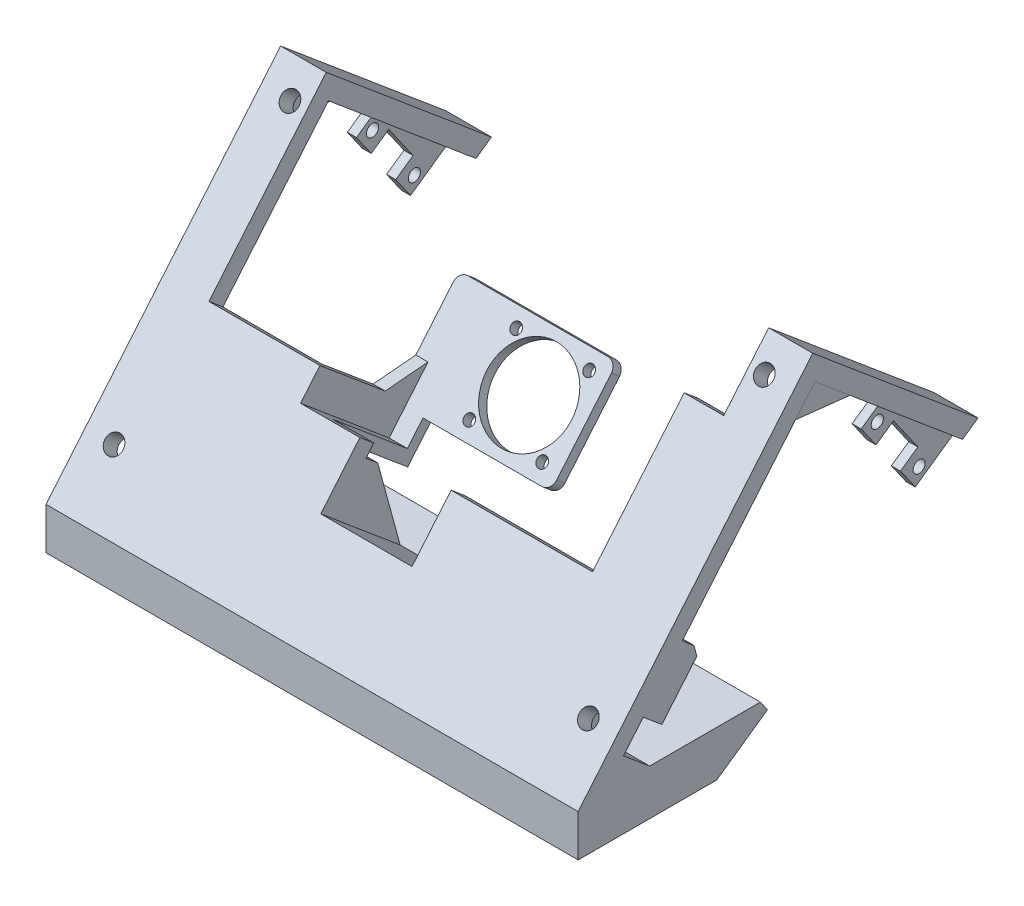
ISO-10303-21;
HEADER;
FILE_DESCRIPTION(('STEP AP214'),'2;1');
FILE_NAME('part.step','',(''),(''),'','','');
FILE_SCHEMA(('AUTOMOTIVE_DESIGN { 1 0 10303 214 1 1 1 1 }'));
ENDSEC;
DATA;
#1=APPLICATION_CONTEXT('core data for automotive mechanical design processes');
#2=APPLICATION_PROTOCOL_DEFINITION('international standard','automotive_design',2000,#1);
#3=PRODUCT_CONTEXT('',#1,'mechanical');
#4=PRODUCT('Part','Part','',(#3));
#5=PRODUCT_RELATED_PRODUCT_CATEGORY('part','',(#4));
#6=PRODUCT_DEFINITION_FORMATION('','',#4);
#7=PRODUCT_DEFINITION_CONTEXT('part definition',#1,'design');
#8=PRODUCT_DEFINITION('design','',#6,#7);
#9=PRODUCT_DEFINITION_SHAPE('','',#8);
#10=(LENGTH_UNIT() NAMED_UNIT(*) SI_UNIT(.MILLI.,.METRE.));
#11=(NAMED_UNIT(*) PLANE_ANGLE_UNIT() SI_UNIT($,.RADIAN.));
#12=(NAMED_UNIT(*) SI_UNIT($,.STERADIAN.) SOLID_ANGLE_UNIT());
#13=UNCERTAINTY_MEASURE_WITH_UNIT(LENGTH_MEASURE(1.E-05),#10,'distance_accuracy_value','');
#14=(GEOMETRIC_REPRESENTATION_CONTEXT(3) GLOBAL_UNCERTAINTY_ASSIGNED_CONTEXT((#13)) GLOBAL_UNIT_ASSIGNED_CONTEXT((#10,
#11,#12)) REPRESENTATION_CONTEXT('',''));
#15=CARTESIAN_POINT('',(0.,0.,0.));
#16=DIRECTION('',(0.,0.,1.));
#17=DIRECTION('',(1.,0.,0.));
#18=AXIS2_PLACEMENT_3D('',#15,#16,#17);
#19=CARTESIAN_POINT('',(-68.,0.,0.));
#20=DIRECTION('',(1.,0.,0.));
#21=DIRECTION('',(0.,0.,-1.));
#22=AXIS2_PLACEMENT_3D('',#19,#20,#21);
#23=PLANE('',#22);
#24=DIRECTION('',(0.,-0.766044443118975,0.642787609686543));
#25=VECTOR('',#24,1.);
#26=CARTESIAN_POINT('',(-68.,34.7531616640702,-9.04607087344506));
#27=LINE('',#26,#25);
#28=CARTESIAN_POINT('',(-68.,34.7531616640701,-9.04607087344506));
#29=VERTEX_POINT('',#28);
#30=CARTESIAN_POINT('',(-68.,21.0271377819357,2.4714307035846));
#31=VERTEX_POINT('',#30);
#32=EDGE_CURVE('E972',#29,#31,#27,.T.);
#33=ORIENTED_EDGE('',*,*,#32,.F.);
#34=DIRECTION('',(0.,-0.964833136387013,-0.262863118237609));
#35=VECTOR('',#34,1.);
#36=CARTESIAN_POINT('',(-68.,11.2,-15.4629913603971));
#37=LINE('',#36,#35);
#38=CARTESIAN_POINT('',(-68.,11.2,-15.4629913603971));
#39=VERTEX_POINT('',#38);
#40=EDGE_CURVE('E969',#29,#39,#37,.T.);
#41=ORIENTED_EDGE('',*,*,#40,.T.);
#42=DIRECTION('',(0.,0.,1.));
#43=VECTOR('',#42,1.);
#44=CARTESIAN_POINT('',(-68.,11.2,-133.799645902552));
#45=LINE('',#44,#43);
#46=CARTESIAN_POINT('',(-68.,11.2,6.48469847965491));
#47=VERTEX_POINT('',#46);
#48=EDGE_CURVE('E503',#39,#47,#45,.T.);
#49=ORIENTED_EDGE('',*,*,#48,.T.);
#50=DIRECTION('',(0.,0.642787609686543,0.766044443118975));
#51=VECTOR('',#50,1.);
#52=CARTESIAN_POINT('',(-68.,-106.512541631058,-133.799645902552));
#53=LINE('',#52,#51);
#54=CARTESIAN_POINT('',(-68.,18.4264888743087,15.0968925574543));
#55=VERTEX_POINT('',#54);
#56=EDGE_CURVE('E1000',#47,#55,#53,.T.);
#57=ORIENTED_EDGE('',*,*,#56,.T.);
#58=DIRECTION('',(0.,0.766044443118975,-0.642787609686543));
#59=VECTOR('',#58,1.);
#60=CARTESIAN_POINT('',(-68.,18.4264888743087,15.0968925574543));
#61=LINE('',#60,#59);
#62=CARTESIAN_POINT('',(-68.,26.1694386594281,8.59978624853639));
#63=VERTEX_POINT('',#62);
#64=EDGE_CURVE('E998',#55,#63,#61,.T.);
#65=ORIENTED_EDGE('',*,*,#64,.T.);
#66=DIRECTION('',(0.,0.642787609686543,0.766044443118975));
#67=VECTOR('',#66,1.);
#68=CARTESIAN_POINT('',(-68.,21.0271377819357,2.4714307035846));
#69=LINE('',#68,#67);
#70=EDGE_CURVE('E970',#31,#63,#69,.T.);
#71=ORIENTED_EDGE('',*,*,#70,.F.);
#72=EDGE_LOOP('',(#33,#41,#49,#57,#65,#71));
#73=FACE_BOUND('',#72,.T.);
#74=ADVANCED_FACE('F45',(#73),#23,.F.);
#75=CARTESIAN_POINT('',(15.8273273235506,11.2,-15.4629913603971));
#76=DIRECTION('',(0.,0.262863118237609,-0.964833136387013));
#77=DIRECTION('',(0.,0.964833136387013,0.262863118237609));
#78=AXIS2_PLACEMENT_3D('',#75,#76,#77);
#79=PLANE('',#78);
#80=DIRECTION('',(0.,0.964833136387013,0.262863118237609));
#81=VECTOR('',#80,1.);
#82=CARTESIAN_POINT('',(-16.5,11.2,-15.4629913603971));
#83=LINE('',#82,#81);
#84=CARTESIAN_POINT('',(-16.5,11.2,-15.4629913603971));
#85=VERTEX_POINT('',#84);
#86=CARTESIAN_POINT('',(-16.5,38.2763894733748,-8.08618816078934));
#87=VERTEX_POINT('',#86);
#88=EDGE_CURVE('E54',#85,#87,#83,.T.);
#89=ORIENTED_EDGE('',*,*,#88,.F.);
#90=DIRECTION('',(-1.,0.,0.));
#91=VECTOR('',#90,1.);
#92=CARTESIAN_POINT('',(15.8273273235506,11.2,-15.4629913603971));
#93=LINE('',#92,#91);
#94=EDGE_CURVE('E1027',#85,#39,#93,.T.);
#95=ORIENTED_EDGE('',*,*,#94,.T.);
#96=ORIENTED_EDGE('',*,*,#40,.F.);
#97=DIRECTION('',(1.,0.,0.));
#98=VECTOR('',#97,1.);
#99=CARTESIAN_POINT('',(-114.52070331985,34.7531616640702,-9.04607087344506));
#100=LINE('',#99,#98);
#101=CARTESIAN_POINT('',(-87.5,34.7531616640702,-9.04607087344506));
#102=VERTEX_POINT('',#101);
#103=EDGE_CURVE('E981',#102,#29,#100,.T.);
#104=ORIENTED_EDGE('',*,*,#103,.F.);
#105=DIRECTION('',(0.,0.964833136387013,0.262863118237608));
#106=VECTOR('',#105,1.);
#107=CARTESIAN_POINT('',(-87.5,38.2763894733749,-8.08618816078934));
#108=LINE('',#107,#106);
#109=CARTESIAN_POINT('',(-87.5,38.2763894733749,-8.08618816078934));
#110=VERTEX_POINT('',#109);
#111=EDGE_CURVE('E961',#102,#110,#108,.T.);
#112=ORIENTED_EDGE('',*,*,#111,.T.);
#113=DIRECTION('',(1.,0.,0.));
#114=VECTOR('',#113,1.);
#115=CARTESIAN_POINT('',(-114.52070331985,38.2763894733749,-8.08618816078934));
#116=LINE('',#115,#114);
#117=CARTESIAN_POINT('',(-40.,38.2763894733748,-8.08618816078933));
#118=VERTEX_POINT('',#117);
#119=EDGE_CURVE('E70',#110,#118,#116,.T.);
#120=ORIENTED_EDGE('',*,*,#119,.T.);
#121=DIRECTION('',(1.,0.,0.));
#122=VECTOR('',#121,1.);
#123=CARTESIAN_POINT('',(-16.5,38.2763894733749,-8.08618816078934));
#124=LINE('',#123,#122);
#125=CARTESIAN_POINT('',(-30.,38.2763894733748,-8.08618816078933));
#126=VERTEX_POINT('',#125);
#127=EDGE_CURVE('E1036',#118,#126,#124,.T.);
#128=ORIENTED_EDGE('',*,*,#127,.T.);
#129=DIRECTION('',(-1.,0.,0.));
#130=VECTOR('',#129,1.);
#131=CARTESIAN_POINT('',(15.8273273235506,38.2763894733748,-8.08618816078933));
#132=LINE('',#131,#130);
#133=EDGE_CURVE('E1185',#87,#126,#132,.T.);
#134=ORIENTED_EDGE('',*,*,#133,.F.);
#135=EDGE_LOOP('',(#89,#95,#96,#104,#112,#120,#128,#134));
#136=FACE_BOUND('',#135,.T.);
#137=ADVANCED_FACE('F47',(#136),#79,.T.);
#138=CARTESIAN_POINT('',(-16.5,86.4044204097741,43.0476703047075));
#139=DIRECTION('',(-1.,0.,0.));
#140=DIRECTION('',(0.,-1.,0.));
#141=AXIS2_PLACEMENT_3D('',#138,#139,#140);
#142=PLANE('',#141);
#143=ORIENTED_EDGE('',*,*,#88,.T.);
#144=DIRECTION('',(0.,0.642787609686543,0.766044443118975));
#145=VECTOR('',#144,1.);
#146=CARTESIAN_POINT('',(-16.5,38.2763894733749,-8.08618816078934));
#147=LINE('',#146,#145);
#148=CARTESIAN_POINT('',(-16.5,41.4903275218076,-4.25596594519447));
#149=VERTEX_POINT('',#148);
#150=EDGE_CURVE('E1044',#87,#149,#147,.T.);
#151=ORIENTED_EDGE('',*,*,#150,.T.);
#152=DIRECTION('',(0.,0.766044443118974,-0.642787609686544));
#153=VECTOR('',#152,1.);
#154=CARTESIAN_POINT('',(-16.5,44.5545052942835,-6.82711638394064));
#155=LINE('',#154,#153);
#156=CARTESIAN_POINT('',(-16.5,44.5545052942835,-6.82711638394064));
#157=VERTEX_POINT('',#156);
#158=EDGE_CURVE('E858',#149,#157,#155,.T.);
#159=ORIENTED_EDGE('',*,*,#158,.T.);
#160=DIRECTION('',(0.,-0.642787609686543,-0.766044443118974));
#161=VECTOR('',#160,1.);
#162=CARTESIAN_POINT('',(-16.5,86.4044204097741,43.0476703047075));
#163=LINE('',#162,#161);
#164=CARTESIAN_POINT('',(-16.5,48.4112309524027,-2.2308497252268));
#165=VERTEX_POINT('',#164);
#166=EDGE_CURVE('E884',#165,#157,#163,.T.);
#167=ORIENTED_EDGE('',*,*,#166,.F.);
#168=DIRECTION('',(0.,-0.766044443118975,0.642787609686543));
#169=VECTOR('',#168,1.);
#170=CARTESIAN_POINT('',(-16.5,48.4112309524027,-2.23084972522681));
#171=LINE('',#170,#169);
#172=CARTESIAN_POINT('',(-16.5,33.0903420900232,10.6249024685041));
#173=VERTEX_POINT('',#172);
#174=EDGE_CURVE('E829',#165,#173,#171,.T.);
#175=ORIENTED_EDGE('',*,*,#174,.T.);
#176=DIRECTION('',(0.,-0.642787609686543,-0.766044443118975));
#177=VECTOR('',#176,1.);
#178=CARTESIAN_POINT('',(-16.5,26.0196783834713,2.19841359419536));
#179=LINE('',#178,#177);
#180=EDGE_CURVE('E12',#173,#85,#179,.T.);
#181=ORIENTED_EDGE('',*,*,#180,.T.);
#182=EDGE_LOOP('',(#143,#151,#159,#167,#175,#181));
#183=FACE_BOUND('',#182,.T.);
#184=ADVANCED_FACE('F1246',(#183),#142,.F.);
#185=CARTESIAN_POINT('',(-114.52070331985,34.7531616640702,-9.04607087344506));
#186=DIRECTION('',(0.,0.642787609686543,0.766044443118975));
#187=DIRECTION('',(0.,-0.766044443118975,0.642787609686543));
#188=AXIS2_PLACEMENT_3D('',#185,#186,#187);
#189=PLANE('',#188);
#190=DIRECTION('',(1.,0.,0.));
#191=VECTOR('',#190,1.);
#192=CARTESIAN_POINT('',(-114.52070331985,21.0271377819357,2.4714307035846));
#193=LINE('',#192,#191);
#194=CARTESIAN_POINT('',(-87.5,21.0271377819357,2.4714307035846));
#195=VERTEX_POINT('',#194);
#196=EDGE_CURVE('E976',#195,#31,#193,.T.);
#197=ORIENTED_EDGE('',*,*,#196,.F.);
#198=DIRECTION('',(0.,0.766044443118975,-0.642787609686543));
#199=VECTOR('',#198,1.);
#200=CARTESIAN_POINT('',(-87.5,34.7531616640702,-9.04607087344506));
#201=LINE('',#200,#199);
#202=EDGE_CURVE('E964',#195,#102,#201,.T.);
#203=ORIENTED_EDGE('',*,*,#202,.T.);
#204=ORIENTED_EDGE('',*,*,#103,.T.);
#205=ORIENTED_EDGE('',*,*,#32,.T.);
#206=EDGE_LOOP('',(#197,#203,#204,#205));
#207=FACE_BOUND('',#206,.T.);
#208=ADVANCED_FACE('F1191',(#207),#189,.F.);
#209=CARTESIAN_POINT('',(-114.52070331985,41.4903275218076,-4.25596594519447));
#210=DIRECTION('',(0.,-0.766044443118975,0.642787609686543));
#211=DIRECTION('',(0.,-0.642787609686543,-0.766044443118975));
#212=AXIS2_PLACEMENT_3D('',#209,#210,#211);
#213=PLANE('',#212);
#214=ORIENTED_EDGE('',*,*,#119,.F.);
#215=DIRECTION('',(0.,0.642787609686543,0.766044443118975));
#216=VECTOR('',#215,1.);
#217=CARTESIAN_POINT('',(-87.5,41.4903275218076,-4.25596594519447));
#218=LINE('',#217,#216);
#219=CARTESIAN_POINT('',(-87.5,41.4903275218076,-4.25596594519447));
#220=VERTEX_POINT('',#219);
#221=EDGE_CURVE('E963',#110,#220,#218,.T.);
#222=ORIENTED_EDGE('',*,*,#221,.T.);
#223=DIRECTION('',(1.,0.,0.));
#224=VECTOR('',#223,1.);
#225=CARTESIAN_POINT('',(-114.52070331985,41.4903275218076,-4.25596594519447));
#226=LINE('',#225,#224);
#227=CARTESIAN_POINT('',(-40.,41.4903275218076,-4.25596594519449));
#228=VERTEX_POINT('',#227);
#229=EDGE_CURVE('E986',#220,#228,#226,.T.);
#230=ORIENTED_EDGE('',*,*,#229,.T.);
#231=DIRECTION('',(0.,0.642787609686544,0.766044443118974));
#232=VECTOR('',#231,1.);
#233=CARTESIAN_POINT('',(-40.,20.9211240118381,-28.7693881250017));
#234=LINE('',#233,#232);
#235=EDGE_CURVE('E808',#118,#228,#234,.T.);
#236=ORIENTED_EDGE('',*,*,#235,.F.);
#237=EDGE_LOOP('',(#214,#222,#230,#236));
#238=FACE_BOUND('',#237,.T.);
#239=ADVANCED_FACE('F1176',(#238),#213,.F.);
#240=CARTESIAN_POINT('',(-114.52070331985,21.0271377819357,2.4714307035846));
#241=DIRECTION('',(0.,0.766044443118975,-0.642787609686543));
#242=DIRECTION('',(0.,0.642787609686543,0.766044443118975));
#243=AXIS2_PLACEMENT_3D('',#240,#241,#242);
#244=PLANE('',#243);
#245=DIRECTION('',(1.,0.,0.));
#246=VECTOR('',#245,1.);
#247=CARTESIAN_POINT('',(-114.52070331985,26.1694386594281,8.59978624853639));
#248=LINE('',#247,#246);
#249=CARTESIAN_POINT('',(-87.5,26.1694386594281,8.59978624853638));
#250=VERTEX_POINT('',#249);
#251=EDGE_CURVE('E1180',#250,#63,#248,.T.);
#252=ORIENTED_EDGE('',*,*,#251,.F.);
#253=DIRECTION('',(0.,-0.642787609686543,-0.766044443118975));
#254=VECTOR('',#253,1.);
#255=CARTESIAN_POINT('',(-87.5,21.0271377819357,2.4714307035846));
#256=LINE('',#255,#254);
#257=EDGE_CURVE('E966',#250,#195,#256,.T.);
#258=ORIENTED_EDGE('',*,*,#257,.T.);
#259=ORIENTED_EDGE('',*,*,#196,.T.);
#260=ORIENTED_EDGE('',*,*,#70,.T.);
#261=EDGE_LOOP('',(#252,#258,#259,#260));
#262=FACE_BOUND('',#261,.T.);
#263=ADVANCED_FACE('F991',(#262),#244,.F.);
#264=CARTESIAN_POINT('',(-87.5,10.,30.));
#265=DIRECTION('',(1.,0.,0.));
#266=DIRECTION('',(0.,0.,-1.));
#267=AXIS2_PLACEMENT_3D('',#264,#265,#266);
#268=PLANE('',#267);
#269=DIRECTION('',(0.,0.,-1.));
#270=VECTOR('',#269,1.);
#271=CARTESIAN_POINT('',(-87.5,11.2,-37.0114244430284));
#272=LINE('',#271,#270);
#273=CARTESIAN_POINT('',(-87.5,11.2,6.48469847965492));
#274=VERTEX_POINT('',#273);
#275=CARTESIAN_POINT('',(-87.5,11.2,-29.9377599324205));
#276=VERTEX_POINT('',#275);
#277=EDGE_CURVE('E506',#274,#276,#272,.T.);
#278=ORIENTED_EDGE('',*,*,#277,.T.);
#279=DIRECTION('',(0.,0.819152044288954,0.5735764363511));
#280=VECTOR('',#279,1.);
#281=CARTESIAN_POINT('',(-87.5,7.87646482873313,-32.264924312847));
#282=LINE('',#281,#280);
#283=CARTESIAN_POINT('',(-87.5,7.87646482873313,-32.264924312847));
#284=VERTEX_POINT('',#283);
#285=EDGE_CURVE('E479',#284,#276,#282,.T.);
#286=ORIENTED_EDGE('',*,*,#285,.F.);
#287=DIRECTION('',(0.,0.573576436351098,-0.819152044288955));
#288=VECTOR('',#287,1.);
#289=CARTESIAN_POINT('',(-87.5,-3.78751448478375,-15.6070355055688));
#290=LINE('',#289,#288);
#291=CARTESIAN_POINT('',(-87.5,-3.78751448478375,-15.6070355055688));
#292=VERTEX_POINT('',#291);
#293=EDGE_CURVE('E676',#292,#284,#290,.T.);
#294=ORIENTED_EDGE('',*,*,#293,.F.);
#295=DIRECTION('',(0.,0.,-1.));
#296=VECTOR('',#295,1.);
#297=CARTESIAN_POINT('',(-87.5,-3.78751448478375,-17.8668286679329));
#298=LINE('',#297,#296);
#299=CARTESIAN_POINT('',(-87.5,-3.78751448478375,30.));
#300=VERTEX_POINT('',#299);
#301=EDGE_CURVE('E706',#300,#292,#298,.T.);
#302=ORIENTED_EDGE('',*,*,#301,.F.);
#303=DIRECTION('',(0.,-1.,0.));
#304=VECTOR('',#303,1.);
#305=CARTESIAN_POINT('',(-87.5,10.,30.));
#306=LINE('',#305,#304);
#307=CARTESIAN_POINT('',(-87.5,10.,30.));
#308=VERTEX_POINT('',#307);
#309=EDGE_CURVE('E946',#308,#300,#306,.T.);
#310=ORIENTED_EDGE('',*,*,#309,.F.);
#311=DIRECTION('',(0.,-0.766044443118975,0.642787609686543));
#312=VECTOR('',#311,1.);
#313=CARTESIAN_POINT('',(-87.5,10.,30.));
#314=LINE('',#313,#312);
#315=CARTESIAN_POINT('',(-87.5,101.951836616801,-47.1567521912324));
#316=VERTEX_POINT('',#315);
#317=EDGE_CURVE('E932',#316,#308,#314,.T.);
#318=ORIENTED_EDGE('',*,*,#317,.F.);
#319=DIRECTION('',(0.,0.642787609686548,0.766044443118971));
#320=VECTOR('',#319,1.);
#321=CARTESIAN_POINT('',(-87.5,98.0951109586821,-51.7530188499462));
#322=LINE('',#321,#320);
#323=CARTESIAN_POINT('',(-87.5,56.3540451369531,-101.498084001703));
#324=VERTEX_POINT('',#323);
#325=EDGE_CURVE('E930',#324,#316,#322,.T.);
#326=ORIENTED_EDGE('',*,*,#325,.F.);
#327=CARTESIAN_POINT('',(-87.5,52.7911850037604,-96.4097924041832));
#328=VERTEX_POINT('',#327);
#329=EDGE_CURVE('E680',#328,#324,#290,.T.);
#330=ORIENTED_EDGE('',*,*,#329,.F.);
#331=DIRECTION('',(0.,0.642787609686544,0.766044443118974));
#332=VECTOR('',#331,1.);
#333=CARTESIAN_POINT('',(-87.5,49.207718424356,-100.68040157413));
#334=LINE('',#333,#332);
#335=CARTESIAN_POINT('',(-87.5,83.8570301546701,-59.3869598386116));
#336=VERTEX_POINT('',#335);
#337=EDGE_CURVE('E722',#328,#336,#334,.T.);
#338=ORIENTED_EDGE('',*,*,#337,.T.);
#339=DIRECTION('',(0.,0.109906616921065,0.993941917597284));
#340=VECTOR('',#339,1.);
#341=CARTESIAN_POINT('',(-87.5,85.8383998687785,-41.4684170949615));
#342=LINE('',#341,#340);
#343=CARTESIAN_POINT('',(-87.5,85.8383998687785,-41.4684170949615));
#344=VERTEX_POINT('',#343);
#345=EDGE_CURVE('E516',#336,#344,#342,.T.);
#346=ORIENTED_EDGE('',*,*,#345,.T.);
#347=DIRECTION('',(0.,0.766044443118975,-0.642787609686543));
#348=VECTOR('',#347,1.);
#349=CARTESIAN_POINT('',(-87.5,98.0951109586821,-51.7530188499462));
#350=LINE('',#349,#348);
#351=EDGE_CURVE('E922',#220,#344,#350,.T.);
#352=ORIENTED_EDGE('',*,*,#351,.F.);
#353=ORIENTED_EDGE('',*,*,#221,.F.);
#354=ORIENTED_EDGE('',*,*,#111,.F.);
#355=ORIENTED_EDGE('',*,*,#202,.F.);
#356=ORIENTED_EDGE('',*,*,#257,.F.);
#357=CARTESIAN_POINT('',(-87.5,18.4264888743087,15.0968925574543));
#358=VERTEX_POINT('',#357);
#359=EDGE_CURVE('E933',#358,#250,#350,.T.);
#360=ORIENTED_EDGE('',*,*,#359,.F.);
#361=DIRECTION('',(0.,-0.642787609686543,-0.766044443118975));
#362=VECTOR('',#361,1.);
#363=CARTESIAN_POINT('',(-87.5,18.4264888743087,15.0968925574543));
#364=LINE('',#363,#362);
#365=EDGE_CURVE('E715',#358,#274,#364,.T.);
#366=ORIENTED_EDGE('',*,*,#365,.T.);
#367=EDGE_LOOP('',(#278,#286,#294,#302,#310,#318,#326,#330,#338,#346,#352,#353,#354,#355,#356,
#360,#366));
#368=FACE_BOUND('',#367,.T.);
#369=ADVANCED_FACE('F1193',(#368),#268,.F.);
#370=CARTESIAN_POINT('',(13.5,71.0835315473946,55.9034224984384));
#371=DIRECTION('',(0.,-0.766044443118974,0.642787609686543));
#372=DIRECTION('',(0.,-0.642787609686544,-0.766044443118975));
#373=AXIS2_PLACEMENT_3D('',#370,#371,#372);
#374=PLANE('',#373);
#375=DIRECTION('',(-1.,0.,0.));
#376=VECTOR('',#375,1.);
#377=CARTESIAN_POINT('',(67.9999999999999,11.2,-15.4629913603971));
#378=LINE('',#377,#376);
#379=CARTESIAN_POINT('',(13.5,11.2,-15.4629913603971));
#380=VERTEX_POINT('',#379);
#381=EDGE_CURVE('E1011',#380,#85,#378,.T.);
#382=ORIENTED_EDGE('',*,*,#381,.T.);
#383=ORIENTED_EDGE('',*,*,#180,.F.);
#384=DIRECTION('',(1.,0.,0.));
#385=VECTOR('',#384,1.);
#386=CARTESIAN_POINT('',(13.5,33.0903420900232,10.6249024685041));
#387=LINE('',#386,#385);
#388=CARTESIAN_POINT('',(13.5,33.0903420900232,10.6249024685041));
#389=VERTEX_POINT('',#388);
#390=EDGE_CURVE('E826',#173,#389,#387,.T.);
#391=ORIENTED_EDGE('',*,*,#390,.T.);
#392=DIRECTION('',(0.,-0.642787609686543,-0.766044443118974));
#393=VECTOR('',#392,1.);
#394=CARTESIAN_POINT('',(13.5,71.0835315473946,55.9034224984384));
#395=LINE('',#394,#393);
#396=EDGE_CURVE('E887',#389,#380,#395,.T.);
#397=ORIENTED_EDGE('',*,*,#396,.T.);
#398=EDGE_LOOP('',(#382,#383,#391,#397));
#399=FACE_BOUND('',#398,.T.);
#400=ADVANCED_FACE('F1022',(#399),#374,.F.);
#401=CARTESIAN_POINT('',(87.5,98.0951109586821,-51.7530188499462));
#402=DIRECTION('',(0.,0.642787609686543,0.766044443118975));
#403=DIRECTION('',(0.,-0.766044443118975,0.642787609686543));
#404=AXIS2_PLACEMENT_3D('',#401,#402,#403);
#405=PLANE('',#404);
#406=CARTESIAN_POINT('',(-78.,90.4346665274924,-45.3251427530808));
#407=DIRECTION('',(0.,0.642787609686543,0.766044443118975));
#408=DIRECTION('',(0.,-0.766044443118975,0.642787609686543));
#409=AXIS2_PLACEMENT_3D('',#406,#407,#408);
#410=CIRCLE('',#409,3.00000000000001);
#411=CARTESIAN_POINT('',(-78.,88.1365331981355,-43.3967799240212));
#412=VERTEX_POINT('',#411);
#413=EDGE_CURVE('E919',#412,#412,#410,.F.);
#414=ORIENTED_EDGE('',*,*,#413,.F.);
#415=EDGE_LOOP('',(#414));
#416=FACE_BOUND('',#415,.T.);
#417=DIRECTION('',(0.,0.766044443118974,-0.642787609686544));
#418=VECTOR('',#417,1.);
#419=CARTESIAN_POINT('',(-40.,52.1324443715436,-13.1857622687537));
#420=LINE('',#419,#418);
#421=CARTESIAN_POINT('',(-40.,52.1324443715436,-13.1857622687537));
#422=VERTEX_POINT('',#421);
#423=EDGE_CURVE('E797',#228,#422,#420,.T.);
#424=ORIENTED_EDGE('',*,*,#423,.F.);
#425=ORIENTED_EDGE('',*,*,#229,.F.);
#426=ORIENTED_EDGE('',*,*,#351,.T.);
#427=DIRECTION('',(-1.,0.,0.));
#428=VECTOR('',#427,1.);
#429=CARTESIAN_POINT('',(-61.152057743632,85.8383998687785,-41.4684170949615));
#430=LINE('',#429,#428);
#431=CARTESIAN_POINT('',(-81.5,85.8383998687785,-41.4684170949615));
#432=VERTEX_POINT('',#431);
#433=EDGE_CURVE('E527',#432,#344,#430,.T.);
#434=ORIENTED_EDGE('',*,*,#433,.F.);
#435=DIRECTION('',(0.,-0.766044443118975,0.642787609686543));
#436=VECTOR('',#435,1.);
#437=CARTESIAN_POINT('',(-81.5,93.4988442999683,-47.896293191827));
#438=LINE('',#437,#436);
#439=CARTESIAN_POINT('',(-81.5,93.4988442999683,-47.896293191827));
#440=VERTEX_POINT('',#439);
#441=EDGE_CURVE('E524',#440,#432,#438,.T.);
#442=ORIENTED_EDGE('',*,*,#441,.F.);
#443=DIRECTION('',(-1.,0.,0.));
#444=VECTOR('',#443,1.);
#445=CARTESIAN_POINT('',(-72.5,93.4988442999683,-47.896293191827));
#446=LINE('',#445,#444);
#447=CARTESIAN_POINT('',(-72.5,93.4988442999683,-47.896293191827));
#448=VERTEX_POINT('',#447);
#449=EDGE_CURVE('E719',#448,#440,#446,.T.);
#450=ORIENTED_EDGE('',*,*,#449,.F.);
#451=DIRECTION('',(0.,0.766044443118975,-0.642787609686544));
#452=VECTOR('',#451,1.);
#453=CARTESIAN_POINT('',(-72.5,52.1324443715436,-13.1857622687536));
#454=LINE('',#453,#452);
#455=CARTESIAN_POINT('',(-72.5,52.1324443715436,-13.1857622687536));
#456=VERTEX_POINT('',#455);
#457=EDGE_CURVE('E865',#456,#448,#454,.T.);
#458=ORIENTED_EDGE('',*,*,#457,.F.);
#459=DIRECTION('',(-1.,0.,0.));
#460=VECTOR('',#459,1.);
#461=CARTESIAN_POINT('',(-36.,52.1324443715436,-13.1857622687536));
#462=LINE('',#461,#460);
#463=EDGE_CURVE('E863',#422,#456,#462,.T.);
#464=ORIENTED_EDGE('',*,*,#463,.F.);
#465=EDGE_LOOP('',(#424,#425,#426,#434,#442,#450,#458,#464));
#466=FACE_BOUND('',#465,.T.);
#467=ADVANCED_FACE('F1196',(#416,#466),#405,.F.);
#468=CARTESIAN_POINT('',(-78.,21.4906666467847,12.5257421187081));
#469=DIRECTION('',(0.,0.642787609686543,0.766044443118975));
#470=DIRECTION('',(0.,-0.766044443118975,0.642787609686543));
#471=AXIS2_PLACEMENT_3D('',#468,#469,#470);
#472=CIRCLE('',#471,3.00000000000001);
#473=CARTESIAN_POINT('',(-78.,19.1925333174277,14.4541049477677));
#474=VERTEX_POINT('',#473);
#475=EDGE_CURVE('E901',#474,#474,#472,.F.);
#476=ORIENTED_EDGE('',*,*,#475,.F.);
#477=EDGE_LOOP('',(#476));
#478=FACE_BOUND('',#477,.T.);
#479=ORIENTED_EDGE('',*,*,#359,.T.);
#480=ORIENTED_EDGE('',*,*,#251,.T.);
#481=ORIENTED_EDGE('',*,*,#64,.F.);
#482=DIRECTION('',(1.,0.,0.));
#483=VECTOR('',#482,1.);
#484=CARTESIAN_POINT('',(-106.575093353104,18.4264888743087,15.0968925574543));
#485=LINE('',#484,#483);
#486=EDGE_CURVE('E712',#358,#55,#485,.T.);
#487=ORIENTED_EDGE('',*,*,#486,.F.);
#488=EDGE_LOOP('',(#479,#480,#481,#487));
#489=FACE_BOUND('',#488,.T.);
#490=ADVANCED_FACE('F1345',(#478,#489),#405,.F.);
#491=CARTESIAN_POINT('',(78.,90.4346665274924,-45.3251427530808));
#492=DIRECTION('',(0.,0.642787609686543,0.766044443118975));
#493=DIRECTION('',(0.,-0.766044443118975,0.642787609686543));
#494=AXIS2_PLACEMENT_3D('',#491,#492,#493);
#495=CIRCLE('',#494,3.00000000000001);
#496=CARTESIAN_POINT('',(78.,88.1365331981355,-43.3967799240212));
#497=VERTEX_POINT('',#496);
#498=EDGE_CURVE('E913',#497,#497,#495,.F.);
#499=ORIENTED_EDGE('',*,*,#498,.F.);
#500=EDGE_LOOP('',(#499));
#501=FACE_BOUND('',#500,.T.);
#502=DIRECTION('',(0.,0.766044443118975,-0.642787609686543));
#503=VECTOR('',#502,1.);
#504=CARTESIAN_POINT('',(87.5,98.0951109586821,-51.7530188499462));
#505=LINE('',#504,#503);
#506=CARTESIAN_POINT('',(87.5,41.4903275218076,-4.2559659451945));
#507=VERTEX_POINT('',#506);
#508=CARTESIAN_POINT('',(87.5,93.4988442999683,-47.896293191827));
#509=VERTEX_POINT('',#508);
#510=EDGE_CURVE('E936',#507,#509,#505,.T.);
#511=ORIENTED_EDGE('',*,*,#510,.F.);
#512=DIRECTION('',(1.,0.,0.));
#513=VECTOR('',#512,1.);
#514=CARTESIAN_POINT('',(68.,41.4903275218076,-4.25596594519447));
#515=LINE('',#514,#513);
#516=CARTESIAN_POINT('',(13.5,41.4903275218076,-4.25596594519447));
#517=VERTEX_POINT('',#516);
#518=EDGE_CURVE('E1051',#517,#507,#515,.T.);
#519=ORIENTED_EDGE('',*,*,#518,.F.);
#520=DIRECTION('',(0.,-0.766044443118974,0.642787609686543));
#521=VECTOR('',#520,1.);
#522=CARTESIAN_POINT('',(13.5,44.5545052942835,-6.82711638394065));
#523=LINE('',#522,#521);
#524=CARTESIAN_POINT('',(13.5,44.5545052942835,-6.82711638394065));
#525=VERTEX_POINT('',#524);
#526=EDGE_CURVE('E855',#525,#517,#523,.T.);
#527=ORIENTED_EDGE('',*,*,#526,.F.);
#528=DIRECTION('',(-1.,0.,0.));
#529=VECTOR('',#528,1.);
#530=CARTESIAN_POINT('',(60.,44.5545052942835,-6.82711638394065));
#531=LINE('',#530,#529);
#532=CARTESIAN_POINT('',(60.,44.5545052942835,-6.82711638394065));
#533=VERTEX_POINT('',#532);
#534=EDGE_CURVE('E852',#533,#525,#531,.T.);
#535=ORIENTED_EDGE('',*,*,#534,.F.);
#536=DIRECTION('',(0.,-0.766044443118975,0.642787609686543));
#537=VECTOR('',#536,1.);
#538=CARTESIAN_POINT('',(60.,80.4760887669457,-36.9689038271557));
#539=LINE('',#538,#537);
#540=CARTESIAN_POINT('',(60.,80.4760887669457,-36.9689038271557));
#541=VERTEX_POINT('',#540);
#542=EDGE_CURVE('E849',#541,#533,#539,.T.);
#543=ORIENTED_EDGE('',*,*,#542,.F.);
#544=DIRECTION('',(-1.,0.,0.));
#545=VECTOR('',#544,1.);
#546=CARTESIAN_POINT('',(73.,80.4760887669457,-36.9689038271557));
#547=LINE('',#546,#545);
#548=CARTESIAN_POINT('',(73.,80.4760887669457,-36.9689038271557));
#549=VERTEX_POINT('',#548);
#550=EDGE_CURVE('E846',#549,#541,#547,.T.);
#551=ORIENTED_EDGE('',*,*,#550,.F.);
#552=DIRECTION('',(0.,-0.766044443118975,0.642787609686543));
#553=VECTOR('',#552,1.);
#554=CARTESIAN_POINT('',(73.,88.2601918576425,-43.5005418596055));
#555=LINE('',#554,#553);
#556=CARTESIAN_POINT('',(73.,93.4988442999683,-47.896293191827));
#557=VERTEX_POINT('',#556);
#558=EDGE_CURVE('E844',#557,#549,#555,.T.);
#559=ORIENTED_EDGE('',*,*,#558,.F.);
#560=DIRECTION('',(-1.,0.,0.));
#561=VECTOR('',#560,1.);
#562=CARTESIAN_POINT('',(73.,93.4988442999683,-47.896293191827));
#563=LINE('',#562,#561);
#564=EDGE_CURVE('E727',#509,#557,#563,.T.);
#565=ORIENTED_EDGE('',*,*,#564,.F.);
#566=EDGE_LOOP('',(#511,#519,#527,#535,#543,#551,#559,#565));
#567=FACE_BOUND('',#566,.T.);
#568=ADVANCED_FACE('F1062',(#501,#567),#405,.F.);
#569=CARTESIAN_POINT('',(78.,21.4906666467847,12.5257421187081));
#570=DIRECTION('',(0.,0.642787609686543,0.766044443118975));
#571=DIRECTION('',(0.,-0.766044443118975,0.642787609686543));
#572=AXIS2_PLACEMENT_3D('',#569,#570,#571);
#573=CIRCLE('',#572,3.00000000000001);
#574=CARTESIAN_POINT('',(78.,19.1925333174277,14.4541049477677));
#575=VERTEX_POINT('',#574);
#576=EDGE_CURVE('E907',#575,#575,#573,.F.);
#577=ORIENTED_EDGE('',*,*,#576,.F.);
#578=EDGE_LOOP('',(#577));
#579=FACE_BOUND('',#578,.T.);
#580=DIRECTION('',(-1.,0.,0.));
#581=VECTOR('',#580,1.);
#582=CARTESIAN_POINT('',(114.520703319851,26.1694386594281,8.59978624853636));
#583=LINE('',#582,#581);
#584=CARTESIAN_POINT('',(87.5,26.1694386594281,8.59978624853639));
#585=VERTEX_POINT('',#584);
#586=CARTESIAN_POINT('',(68.,26.1694386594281,8.5997862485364));
#587=VERTEX_POINT('',#586);
#588=EDGE_CURVE('E1287',#585,#587,#583,.T.);
#589=ORIENTED_EDGE('',*,*,#588,.F.);
#590=CARTESIAN_POINT('',(87.5,18.4264888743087,15.0968925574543));
#591=VERTEX_POINT('',#590);
#592=EDGE_CURVE('E926',#591,#585,#505,.T.);
#593=ORIENTED_EDGE('',*,*,#592,.F.);
#594=CARTESIAN_POINT('',(68.,18.4264888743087,15.0968925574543));
#595=VERTEX_POINT('',#594);
#596=EDGE_CURVE('E711',#595,#591,#485,.T.);
#597=ORIENTED_EDGE('',*,*,#596,.F.);
#598=DIRECTION('',(0.,-0.766044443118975,0.642787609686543));
#599=VECTOR('',#598,1.);
#600=CARTESIAN_POINT('',(68.,18.4264888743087,15.0968925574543));
#601=LINE('',#600,#599);
#602=EDGE_CURVE('E1003',#587,#595,#601,.T.);
#603=ORIENTED_EDGE('',*,*,#602,.F.);
#604=EDGE_LOOP('',(#589,#593,#597,#603));
#605=FACE_BOUND('',#604,.T.);
#606=ADVANCED_FACE('F1303',(#579,#605),#405,.F.);
#607=CARTESIAN_POINT('',(68.,-106.512541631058,-133.799645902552));
#608=DIRECTION('',(-1.,0.,0.));
#609=DIRECTION('',(0.,-1.,0.));
#610=AXIS2_PLACEMENT_3D('',#607,#608,#609);
#611=PLANE('',#610);
#612=DIRECTION('',(0.,0.766044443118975,-0.642787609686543));
#613=VECTOR('',#612,1.);
#614=CARTESIAN_POINT('',(68.,21.0271377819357,2.4714307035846));
#615=LINE('',#614,#613);
#616=CARTESIAN_POINT('',(68.,21.0271377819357,2.47143070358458));
#617=VERTEX_POINT('',#616);
#618=CARTESIAN_POINT('',(68.,34.7531616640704,-9.04607087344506));
#619=VERTEX_POINT('',#618);
#620=EDGE_CURVE('E1273',#617,#619,#615,.T.);
#621=ORIENTED_EDGE('',*,*,#620,.F.);
#622=DIRECTION('',(0.,-0.642787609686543,-0.766044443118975));
#623=VECTOR('',#622,1.);
#624=CARTESIAN_POINT('',(68.,26.1694386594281,8.59978624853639));
#625=LINE('',#624,#623);
#626=EDGE_CURVE('E1270',#587,#617,#625,.T.);
#627=ORIENTED_EDGE('',*,*,#626,.F.);
#628=ORIENTED_EDGE('',*,*,#602,.T.);
#629=DIRECTION('',(0.,0.642787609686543,0.766044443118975));
#630=VECTOR('',#629,1.);
#631=CARTESIAN_POINT('',(68.,-106.512541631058,-133.799645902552));
#632=LINE('',#631,#630);
#633=CARTESIAN_POINT('',(67.9999999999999,11.2,6.48469847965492));
#634=VERTEX_POINT('',#633);
#635=EDGE_CURVE('E1005',#634,#595,#632,.T.);
#636=ORIENTED_EDGE('',*,*,#635,.F.);
#637=DIRECTION('',(0.,0.,-1.));
#638=VECTOR('',#637,1.);
#639=CARTESIAN_POINT('',(67.9999999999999,11.2,-133.799645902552));
#640=LINE('',#639,#638);
#641=CARTESIAN_POINT('',(68.,11.2,-15.4629913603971));
#642=VERTEX_POINT('',#641);
#643=EDGE_CURVE('E499',#634,#642,#640,.T.);
#644=ORIENTED_EDGE('',*,*,#643,.T.);
#645=DIRECTION('',(0.,0.964833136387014,0.262863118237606));
#646=VECTOR('',#645,1.);
#647=CARTESIAN_POINT('',(68.,11.2,-15.4629913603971));
#648=LINE('',#647,#646);
#649=EDGE_CURVE('E1033',#642,#619,#648,.T.);
#650=ORIENTED_EDGE('',*,*,#649,.T.);
#651=EDGE_LOOP('',(#621,#627,#628,#636,#644,#650));
#652=FACE_BOUND('',#651,.T.);
#653=ADVANCED_FACE('F1300',(#652),#611,.F.);
#654=DIRECTION('',(1.,0.,0.));
#655=VECTOR('',#654,1.);
#656=CARTESIAN_POINT('',(-16.5,41.4903275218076,-4.25596594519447));
#657=LINE('',#656,#655);
#658=CARTESIAN_POINT('',(-30.,41.4903275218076,-4.25596594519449));
#659=VERTEX_POINT('',#658);
#660=EDGE_CURVE('E1032',#659,#149,#657,.T.);
#661=ORIENTED_EDGE('',*,*,#660,.F.);
#662=DIRECTION('',(0.,-0.766044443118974,0.642787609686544));
#663=VECTOR('',#662,1.);
#664=CARTESIAN_POINT('',(-30.,41.4903275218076,-4.25596594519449));
#665=LINE('',#664,#663);
#666=CARTESIAN_POINT('',(-30.,44.5545052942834,-6.82711638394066));
#667=VERTEX_POINT('',#666);
#668=EDGE_CURVE('E788',#667,#659,#665,.T.);
#669=ORIENTED_EDGE('',*,*,#668,.F.);
#670=DIRECTION('',(-1.,0.,0.));
#671=VECTOR('',#670,1.);
#672=CARTESIAN_POINT('',(-26.2749164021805,44.5545052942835,-6.82711638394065));
#673=LINE('',#672,#671);
#674=EDGE_CURVE('E860',#157,#667,#673,.T.);
#675=ORIENTED_EDGE('',*,*,#674,.F.);
#676=ORIENTED_EDGE('',*,*,#158,.F.);
#677=EDGE_LOOP('',(#661,#669,#675,#676));
#678=FACE_BOUND('',#677,.T.);
#679=ADVANCED_FACE('F1241',(#678),#405,.F.);
#680=CARTESIAN_POINT('',(-40.,20.9211240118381,-28.7693881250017));
#681=DIRECTION('',(0.,0.766044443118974,-0.642787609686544));
#682=DIRECTION('',(0.,0.642787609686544,0.766044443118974));
#683=AXIS2_PLACEMENT_3D('',#680,#681,#682);
#684=PLANE('',#683);
#685=ORIENTED_EDGE('',*,*,#127,.F.);
#686=CARTESIAN_POINT('',(-40.,18.6713673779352,-31.4505436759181));
#687=VERTEX_POINT('',#686);
#688=EDGE_CURVE('E809',#687,#118,#234,.T.);
#689=ORIENTED_EDGE('',*,*,#688,.F.);
#690=DIRECTION('',(-1.,0.,0.));
#691=VECTOR('',#690,1.);
#692=CARTESIAN_POINT('',(-40.,18.6713673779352,-31.4505436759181));
#693=LINE('',#692,#691);
#694=CARTESIAN_POINT('',(-30.,18.6713673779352,-31.4505436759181));
#695=VERTEX_POINT('',#694);
#696=EDGE_CURVE('E786',#695,#687,#693,.T.);
#697=ORIENTED_EDGE('',*,*,#696,.F.);
#698=DIRECTION('',(0.,0.642787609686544,0.766044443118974));
#699=VECTOR('',#698,1.);
#700=CARTESIAN_POINT('',(-30.,20.9211240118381,-28.7693881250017));
#701=LINE('',#700,#699);
#702=EDGE_CURVE('E812',#695,#126,#701,.T.);
#703=ORIENTED_EDGE('',*,*,#702,.T.);
#704=EDGE_LOOP('',(#685,#689,#697,#703));
#705=FACE_BOUND('',#704,.T.);
#706=ADVANCED_FACE('F1171',(#705),#684,.F.);
#707=CARTESIAN_POINT('',(-106.575093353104,18.4264888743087,15.0968925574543));
#708=DIRECTION('',(0.,0.766044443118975,-0.642787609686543));
#709=DIRECTION('',(0.,0.642787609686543,0.766044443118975));
#710=AXIS2_PLACEMENT_3D('',#707,#708,#709);
#711=PLANE('',#710);
#712=ORIENTED_EDGE('',*,*,#486,.T.);
#713=ORIENTED_EDGE('',*,*,#56,.F.);
#714=DIRECTION('',(1.,0.,0.));
#715=VECTOR('',#714,1.);
#716=CARTESIAN_POINT('',(-131.012672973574,11.2,6.48469847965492));
#717=LINE('',#716,#715);
#718=EDGE_CURVE('E501',#274,#47,#717,.T.);
#719=ORIENTED_EDGE('',*,*,#718,.F.);
#720=ORIENTED_EDGE('',*,*,#365,.F.);
#721=EDGE_LOOP('',(#712,#713,#719,#720));
#722=FACE_BOUND('',#721,.T.);
#723=ADVANCED_FACE('F1392',(#722),#711,.T.);
#724=CARTESIAN_POINT('',(87.5,11.2,6.48469847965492));
#725=VERTEX_POINT('',#724);
#726=EDGE_CURVE('E497',#634,#725,#717,.T.);
#727=ORIENTED_EDGE('',*,*,#726,.F.);
#728=ORIENTED_EDGE('',*,*,#635,.T.);
#729=ORIENTED_EDGE('',*,*,#596,.T.);
#730=DIRECTION('',(0.,0.642787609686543,0.766044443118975));
#731=VECTOR('',#730,1.);
#732=CARTESIAN_POINT('',(87.5,18.4264888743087,15.0968925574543));
#733=LINE('',#732,#731);
#734=EDGE_CURVE('E709',#725,#591,#733,.T.);
#735=ORIENTED_EDGE('',*,*,#734,.F.);
#736=EDGE_LOOP('',(#727,#728,#729,#735));
#737=FACE_BOUND('',#736,.T.);
#738=ADVANCED_FACE('F1305',(#737),#711,.T.);
#739=CARTESIAN_POINT('',(-131.012672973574,11.2,-37.0114244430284));
#740=DIRECTION('',(0.,1.,0.));
#741=DIRECTION('',(0.,0.,1.));
#742=AXIS2_PLACEMENT_3D('',#739,#740,#741);
#743=PLANE('',#742);
#744=DIRECTION('',(1.,0.,0.));
#745=VECTOR('',#744,1.);
#746=CARTESIAN_POINT('',(-95.3155368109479,11.2,-29.9377599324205));
#747=LINE('',#746,#745);
#748=CARTESIAN_POINT('',(87.5,11.2,-29.9377599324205));
#749=VERTEX_POINT('',#748);
#750=EDGE_CURVE('E476',#276,#749,#747,.T.);
#751=ORIENTED_EDGE('',*,*,#750,.F.);
#752=ORIENTED_EDGE('',*,*,#277,.F.);
#753=ORIENTED_EDGE('',*,*,#718,.T.);
#754=ORIENTED_EDGE('',*,*,#48,.F.);
#755=ORIENTED_EDGE('',*,*,#94,.F.);
#756=ORIENTED_EDGE('',*,*,#381,.F.);
#757=EDGE_CURVE('E1012',#642,#380,#378,.T.);
#758=ORIENTED_EDGE('',*,*,#757,.F.);
#759=ORIENTED_EDGE('',*,*,#643,.F.);
#760=ORIENTED_EDGE('',*,*,#726,.T.);
#761=DIRECTION('',(0.,0.,1.));
#762=VECTOR('',#761,1.);
#763=CARTESIAN_POINT('',(87.5,11.2,-37.0114244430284));
#764=LINE('',#763,#762);
#765=EDGE_CURVE('E489',#749,#725,#764,.T.);
#766=ORIENTED_EDGE('',*,*,#765,.F.);
#767=EDGE_LOOP('',(#751,#752,#753,#754,#755,#756,#758,#759,#760,#766));
#768=FACE_BOUND('',#767,.T.);
#769=ADVANCED_FACE('F494',(#768),#743,.T.);
#770=CARTESIAN_POINT('',(-72.5,49.207718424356,-100.68040157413));
#771=DIRECTION('',(0.,0.766044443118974,-0.642787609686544));
#772=DIRECTION('',(0.,0.642787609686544,0.766044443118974));
#773=AXIS2_PLACEMENT_3D('',#770,#771,#772);
#774=PLANE('',#773);
#775=DIRECTION('',(0.,0.642787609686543,0.766044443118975));
#776=VECTOR('',#775,1.);
#777=CARTESIAN_POINT('',(-81.5,83.8570301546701,-59.3869598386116));
#778=LINE('',#777,#776);
#779=CARTESIAN_POINT('',(-81.5,83.8570301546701,-59.3869598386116));
#780=VERTEX_POINT('',#779);
#781=EDGE_CURVE('E517',#780,#440,#778,.T.);
#782=ORIENTED_EDGE('',*,*,#781,.F.);
#783=DIRECTION('',(-1.,0.,0.));
#784=VECTOR('',#783,1.);
#785=CARTESIAN_POINT('',(-61.152057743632,83.8570301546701,-59.3869598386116));
#786=LINE('',#785,#784);
#787=EDGE_CURVE('E521',#780,#336,#786,.T.);
#788=ORIENTED_EDGE('',*,*,#787,.T.);
#789=ORIENTED_EDGE('',*,*,#337,.F.);
#790=DIRECTION('',(1.,0.,0.));
#791=VECTOR('',#790,1.);
#792=CARTESIAN_POINT('',(-72.5,52.7911850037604,-96.4097924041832));
#793=LINE('',#792,#791);
#794=CARTESIAN_POINT('',(-84.5,52.7911850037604,-96.4097924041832));
#795=VERTEX_POINT('',#794);
#796=EDGE_CURVE('E690',#328,#795,#793,.T.);
#797=ORIENTED_EDGE('',*,*,#796,.T.);
#798=DIRECTION('',(0.,0.642787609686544,0.766044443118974));
#799=VECTOR('',#798,1.);
#800=CARTESIAN_POINT('',(-84.5,73.4205287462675,-71.8246978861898));
#801=LINE('',#800,#799);
#802=CARTESIAN_POINT('',(-84.5,73.4205287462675,-71.8246978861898));
#803=VERTEX_POINT('',#802);
#804=EDGE_CURVE('E569',#795,#803,#801,.T.);
#805=ORIENTED_EDGE('',*,*,#804,.T.);
#806=DIRECTION('',(-1.,0.,0.));
#807=VECTOR('',#806,1.);
#808=CARTESIAN_POINT('',(-81.5,73.4205287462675,-71.8246978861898));
#809=LINE('',#808,#807);
#810=CARTESIAN_POINT('',(-81.5,73.4205287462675,-71.8246978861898));
#811=VERTEX_POINT('',#810);
#812=EDGE_CURVE('E566',#811,#803,#809,.T.);
#813=ORIENTED_EDGE('',*,*,#812,.F.);
#814=DIRECTION('',(0.,0.642787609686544,0.766044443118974));
#815=VECTOR('',#814,1.);
#816=CARTESIAN_POINT('',(-81.5,73.4205287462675,-71.8246978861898));
#817=LINE('',#816,#815);
#818=CARTESIAN_POINT('',(-81.5,52.7911850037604,-96.4097924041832));
#819=VERTEX_POINT('',#818);
#820=EDGE_CURVE('E549',#819,#811,#817,.T.);
#821=ORIENTED_EDGE('',*,*,#820,.F.);
#822=CARTESIAN_POINT('',(-72.5,52.7911850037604,-96.4097924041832));
#823=VERTEX_POINT('',#822);
#824=EDGE_CURVE('E679',#819,#823,#793,.T.);
#825=ORIENTED_EDGE('',*,*,#824,.T.);
#826=DIRECTION('',(0.,0.642787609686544,0.766044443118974));
#827=VECTOR('',#826,1.);
#828=CARTESIAN_POINT('',(-72.5,49.207718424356,-100.68040157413));
#829=LINE('',#828,#827);
#830=EDGE_CURVE('E718',#823,#448,#829,.T.);
#831=ORIENTED_EDGE('',*,*,#830,.T.);
#832=ORIENTED_EDGE('',*,*,#449,.T.);
#833=EDGE_LOOP('',(#782,#788,#789,#797,#805,#813,#821,#825,#831,#832));
#834=FACE_BOUND('',#833,.T.);
#835=ADVANCED_FACE('F1206',(#834),#774,.F.);
#836=CARTESIAN_POINT('',(73.,49.207718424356,-100.68040157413));
#837=DIRECTION('',(0.,0.766044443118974,-0.642787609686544));
#838=DIRECTION('',(0.,0.642787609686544,0.766044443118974));
#839=AXIS2_PLACEMENT_3D('',#836,#837,#838);
#840=PLANE('',#839);
#841=DIRECTION('',(0.,0.642787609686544,0.766044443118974));
#842=VECTOR('',#841,1.);
#843=CARTESIAN_POINT('',(81.5,73.4205287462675,-71.8246978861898));
#844=LINE('',#843,#842);
#845=CARTESIAN_POINT('',(81.5,52.7911850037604,-96.4097924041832));
#846=VERTEX_POINT('',#845);
#847=CARTESIAN_POINT('',(81.5,73.4205287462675,-71.8246978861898));
#848=VERTEX_POINT('',#847);
#849=EDGE_CURVE('E638',#846,#848,#844,.T.);
#850=ORIENTED_EDGE('',*,*,#849,.T.);
#851=DIRECTION('',(1.,0.,0.));
#852=VECTOR('',#851,1.);
#853=CARTESIAN_POINT('',(81.5,73.4205287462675,-71.8246978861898));
#854=LINE('',#853,#852);
#855=CARTESIAN_POINT('',(84.5,73.4205287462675,-71.8246978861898));
#856=VERTEX_POINT('',#855);
#857=EDGE_CURVE('E663',#848,#856,#854,.T.);
#858=ORIENTED_EDGE('',*,*,#857,.T.);
#859=DIRECTION('',(0.,0.642787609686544,0.766044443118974));
#860=VECTOR('',#859,1.);
#861=CARTESIAN_POINT('',(84.5,73.4205287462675,-71.8246978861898));
#862=LINE('',#861,#860);
#863=CARTESIAN_POINT('',(84.5,52.7911850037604,-96.4097924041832));
#864=VERTEX_POINT('',#863);
#865=EDGE_CURVE('E620',#864,#856,#862,.T.);
#866=ORIENTED_EDGE('',*,*,#865,.F.);
#867=DIRECTION('',(1.,0.,0.));
#868=VECTOR('',#867,1.);
#869=CARTESIAN_POINT('',(73.,52.7911850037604,-96.4097924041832));
#870=LINE('',#869,#868);
#871=CARTESIAN_POINT('',(87.5,52.7911850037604,-96.4097924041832));
#872=VERTEX_POINT('',#871);
#873=EDGE_CURVE('E695',#864,#872,#870,.T.);
#874=ORIENTED_EDGE('',*,*,#873,.T.);
#875=DIRECTION('',(0.,0.642787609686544,0.766044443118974));
#876=VECTOR('',#875,1.);
#877=CARTESIAN_POINT('',(87.5,49.207718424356,-100.68040157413));
#878=LINE('',#877,#876);
#879=EDGE_CURVE('E731',#872,#509,#878,.T.);
#880=ORIENTED_EDGE('',*,*,#879,.T.);
#881=ORIENTED_EDGE('',*,*,#564,.T.);
#882=DIRECTION('',(0.,0.642787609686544,0.766044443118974));
#883=VECTOR('',#882,1.);
#884=CARTESIAN_POINT('',(73.,49.207718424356,-100.68040157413));
#885=LINE('',#884,#883);
#886=CARTESIAN_POINT('',(73.,52.7911850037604,-96.4097924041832));
#887=VERTEX_POINT('',#886);
#888=EDGE_CURVE('E726',#887,#557,#885,.T.);
#889=ORIENTED_EDGE('',*,*,#888,.F.);
#890=EDGE_CURVE('E696',#887,#846,#870,.T.);
#891=ORIENTED_EDGE('',*,*,#890,.T.);
#892=EDGE_LOOP('',(#850,#858,#866,#874,#880,#881,#889,#891));
#893=FACE_BOUND('',#892,.T.);
#894=ADVANCED_FACE('F1096',(#893),#840,.F.);
#895=CARTESIAN_POINT('',(87.5,98.0951109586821,-51.7530188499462));
#896=DIRECTION('',(0.,-0.766044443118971,0.642787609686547));
#897=DIRECTION('',(0.,-0.642787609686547,-0.766044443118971));
#898=AXIS2_PLACEMENT_3D('',#895,#896,#897);
#899=PLANE('',#898);
#900=DIRECTION('',(0.,-0.642787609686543,-0.766044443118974));
#901=VECTOR('',#900,1.);
#902=CARTESIAN_POINT('',(-72.5,139.945026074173,-1.87823216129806));
#903=LINE('',#902,#901);
#904=CARTESIAN_POINT('',(-72.5,101.951836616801,-47.1567521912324));
#905=VERTEX_POINT('',#904);
#906=CARTESIAN_POINT('',(-72.5,56.3540451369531,-101.498084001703));
#907=VERTEX_POINT('',#906);
#908=EDGE_CURVE('E873',#905,#907,#903,.T.);
#909=ORIENTED_EDGE('',*,*,#908,.T.);
#910=DIRECTION('',(1.,0.,0.));
#911=VECTOR('',#910,1.);
#912=CARTESIAN_POINT('',(-193.197297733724,56.3540451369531,-101.498084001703));
#913=LINE('',#912,#911);
#914=EDGE_CURVE('E688',#324,#907,#913,.T.);
#915=ORIENTED_EDGE('',*,*,#914,.F.);
#916=ORIENTED_EDGE('',*,*,#325,.T.);
#917=DIRECTION('',(-1.,0.,0.));
#918=VECTOR('',#917,1.);
#919=CARTESIAN_POINT('',(87.5,101.951836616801,-47.1567521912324));
#920=LINE('',#919,#918);
#921=EDGE_CURVE('E929',#905,#316,#920,.T.);
#922=ORIENTED_EDGE('',*,*,#921,.F.);
#923=EDGE_LOOP('',(#909,#915,#916,#922));
#924=FACE_BOUND('',#923,.T.);
#925=ADVANCED_FACE('F1255',(#924),#899,.F.);
#926=CARTESIAN_POINT('',(87.5,10.,30.));
#927=DIRECTION('',(-1.,0.,0.));
#928=DIRECTION('',(0.,0.,1.));
#929=AXIS2_PLACEMENT_3D('',#926,#927,#928);
#930=PLANE('',#929);
#931=DIRECTION('',(0.,-0.573576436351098,0.819152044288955));
#932=VECTOR('',#931,1.);
#933=CARTESIAN_POINT('',(87.5,-3.78751448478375,-15.6070355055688));
#934=LINE('',#933,#932);
#935=CARTESIAN_POINT('',(87.5,7.87646482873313,-32.2649243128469));
#936=VERTEX_POINT('',#935);
#937=CARTESIAN_POINT('',(87.5,-3.78751448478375,-15.6070355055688));
#938=VERTEX_POINT('',#937);
#939=EDGE_CURVE('E492',#936,#938,#934,.T.);
#940=ORIENTED_EDGE('',*,*,#939,.F.);
#941=DIRECTION('',(0.,-0.819152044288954,-0.5735764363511));
#942=VECTOR('',#941,1.);
#943=CARTESIAN_POINT('',(87.5,7.87646482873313,-32.264924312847));
#944=LINE('',#943,#942);
#945=EDGE_CURVE('E62',#749,#936,#944,.T.);
#946=ORIENTED_EDGE('',*,*,#945,.F.);
#947=ORIENTED_EDGE('',*,*,#765,.T.);
#948=ORIENTED_EDGE('',*,*,#734,.T.);
#949=ORIENTED_EDGE('',*,*,#592,.T.);
#950=DIRECTION('',(0.,0.642787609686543,0.766044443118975));
#951=VECTOR('',#950,1.);
#952=CARTESIAN_POINT('',(87.5,26.1694386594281,8.59978624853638));
#953=LINE('',#952,#951);
#954=CARTESIAN_POINT('',(87.5,21.0271377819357,2.4714307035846));
#955=VERTEX_POINT('',#954);
#956=EDGE_CURVE('E1038',#955,#585,#953,.T.);
#957=ORIENTED_EDGE('',*,*,#956,.F.);
#958=DIRECTION('',(0.,-0.766044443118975,0.642787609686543));
#959=VECTOR('',#958,1.);
#960=CARTESIAN_POINT('',(87.5,21.0271377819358,2.47143070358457));
#961=LINE('',#960,#959);
#962=CARTESIAN_POINT('',(87.5,34.7531616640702,-9.04607087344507));
#963=VERTEX_POINT('',#962);
#964=EDGE_CURVE('E1281',#963,#955,#961,.T.);
#965=ORIENTED_EDGE('',*,*,#964,.F.);
#966=DIRECTION('',(0.,-0.964833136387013,-0.262863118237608));
#967=VECTOR('',#966,1.);
#968=CARTESIAN_POINT('',(87.5,34.7531616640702,-9.04607087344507));
#969=LINE('',#968,#967);
#970=CARTESIAN_POINT('',(87.5,38.2763894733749,-8.08618816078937));
#971=VERTEX_POINT('',#970);
#972=EDGE_CURVE('E1278',#971,#963,#969,.T.);
#973=ORIENTED_EDGE('',*,*,#972,.F.);
#974=DIRECTION('',(0.,-0.642787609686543,-0.766044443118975));
#975=VECTOR('',#974,1.);
#976=CARTESIAN_POINT('',(87.5,41.4903275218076,-4.25596594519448));
#977=LINE('',#976,#975);
#978=EDGE_CURVE('E1101',#507,#971,#977,.T.);
#979=ORIENTED_EDGE('',*,*,#978,.F.);
#980=ORIENTED_EDGE('',*,*,#510,.T.);
#981=ORIENTED_EDGE('',*,*,#879,.F.);
#982=CARTESIAN_POINT('',(87.5,56.3540451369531,-101.498084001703));
#983=VERTEX_POINT('',#982);
#984=EDGE_CURVE('E681',#983,#872,#934,.T.);
#985=ORIENTED_EDGE('',*,*,#984,.F.);
#986=DIRECTION('',(0.,0.642787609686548,0.766044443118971));
#987=VECTOR('',#986,1.);
#988=CARTESIAN_POINT('',(87.5,98.0951109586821,-51.7530188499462));
#989=LINE('',#988,#987);
#990=CARTESIAN_POINT('',(87.5,101.951836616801,-47.1567521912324));
#991=VERTEX_POINT('',#990);
#992=EDGE_CURVE('E923',#983,#991,#989,.T.);
#993=ORIENTED_EDGE('',*,*,#992,.T.);
#994=DIRECTION('',(0.,-0.766044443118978,0.64278760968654));
#995=VECTOR('',#994,1.);
#996=CARTESIAN_POINT('',(87.5,101.951836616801,-47.1567521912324));
#997=LINE('',#996,#995);
#998=CARTESIAN_POINT('',(87.5,10.,30.));
#999=VERTEX_POINT('',#998);
#1000=EDGE_CURVE('E925',#991,#999,#997,.T.);
#1001=ORIENTED_EDGE('',*,*,#1000,.T.);
#1002=DIRECTION('',(0.,-1.,0.));
#1003=VECTOR('',#1002,1.);
#1004=CARTESIAN_POINT('',(87.5,10.,30.));
#1005=LINE('',#1004,#1003);
#1006=CARTESIAN_POINT('',(87.5,-3.78751448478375,30.));
#1007=VERTEX_POINT('',#1006);
#1008=EDGE_CURVE('E943',#999,#1007,#1005,.T.);
#1009=ORIENTED_EDGE('',*,*,#1008,.T.);
#1010=DIRECTION('',(0.,0.,1.));
#1011=VECTOR('',#1010,1.);
#1012=CARTESIAN_POINT('',(87.5,-3.78751448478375,30.819152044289));
#1013=LINE('',#1012,#1011);
#1014=EDGE_CURVE('E704',#938,#1007,#1013,.T.);
#1015=ORIENTED_EDGE('',*,*,#1014,.F.);
#1016=EDGE_LOOP('',(#940,#946,#947,#948,#949,#957,#965,#973,#979,#980,#981,#985,#993,#1001,
#1009,#1015));
#1017=FACE_BOUND('',#1016,.T.);
#1018=ADVANCED_FACE('F487',(#1017),#930,.F.);
#1019=CARTESIAN_POINT('',(-87.5,10.,30.));
#1020=DIRECTION('',(0.,0.,-1.));
#1021=DIRECTION('',(-1.,0.,0.));
#1022=AXIS2_PLACEMENT_3D('',#1019,#1020,#1021);
#1023=PLANE('',#1022);
#1024=ORIENTED_EDGE('',*,*,#309,.T.);
#1025=DIRECTION('',(-1.,0.,0.));
#1026=VECTOR('',#1025,1.);
#1027=CARTESIAN_POINT('',(87.501,-3.78751448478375,30.));
#1028=LINE('',#1027,#1026);
#1029=EDGE_CURVE('E701',#1007,#300,#1028,.T.);
#1030=ORIENTED_EDGE('',*,*,#1029,.F.);
#1031=ORIENTED_EDGE('',*,*,#1008,.F.);
#1032=DIRECTION('',(1.,0.,0.));
#1033=VECTOR('',#1032,1.);
#1034=CARTESIAN_POINT('',(-87.5,10.,30.));
#1035=LINE('',#1034,#1033);
#1036=EDGE_CURVE('E940',#308,#999,#1035,.T.);
#1037=ORIENTED_EDGE('',*,*,#1036,.F.);
#1038=EDGE_LOOP('',(#1024,#1030,#1031,#1037));
#1039=FACE_BOUND('',#1038,.T.);
#1040=ADVANCED_FACE('F1263',(#1039),#1023,.F.);
#1041=ORIENTED_EDGE('',*,*,#992,.F.);
#1042=CARTESIAN_POINT('',(73.,56.3540451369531,-101.498084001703));
#1043=VERTEX_POINT('',#1042);
#1044=EDGE_CURVE('E684',#1043,#983,#913,.T.);
#1045=ORIENTED_EDGE('',*,*,#1044,.F.);
#1046=DIRECTION('',(0.,-0.642787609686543,-0.766044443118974));
#1047=VECTOR('',#1046,1.);
#1048=CARTESIAN_POINT('',(73.,139.945026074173,-1.87823216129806));
#1049=LINE('',#1048,#1047);
#1050=CARTESIAN_POINT('',(73.,101.951836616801,-47.1567521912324));
#1051=VERTEX_POINT('',#1050);
#1052=EDGE_CURVE('E869',#1051,#1043,#1049,.T.);
#1053=ORIENTED_EDGE('',*,*,#1052,.F.);
#1054=EDGE_CURVE('E937',#991,#1051,#920,.T.);
#1055=ORIENTED_EDGE('',*,*,#1054,.F.);
#1056=EDGE_LOOP('',(#1041,#1045,#1053,#1055));
#1057=FACE_BOUND('',#1056,.T.);
#1058=ADVANCED_FACE('F1091',(#1057),#899,.F.);
#1059=CARTESIAN_POINT('',(87.5,10.,30.));
#1060=DIRECTION('',(0.,-0.642787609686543,-0.766044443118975));
#1061=DIRECTION('',(0.,0.766044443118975,-0.642787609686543));
#1062=AXIS2_PLACEMENT_3D('',#1059,#1060,#1061);
#1063=PLANE('',#1062);
#1064=CARTESIAN_POINT('',(-78.,25.3473923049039,17.122008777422));
#1065=DIRECTION('',(0.,0.642787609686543,0.766044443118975));
#1066=DIRECTION('',(0.,-0.766044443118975,0.642787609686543));
#1067=AXIS2_PLACEMENT_3D('',#1064,#1065,#1066);
#1068=CIRCLE('',#1067,3.00000000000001);
#1069=CARTESIAN_POINT('',(-78.,23.049258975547,19.0503716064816));
#1070=VERTEX_POINT('',#1069);
#1071=EDGE_CURVE('E898',#1070,#1070,#1068,.T.);
#1072=ORIENTED_EDGE('',*,*,#1071,.F.);
#1073=EDGE_LOOP('',(#1072));
#1074=FACE_BOUND('',#1073,.T.);
#1075=CARTESIAN_POINT('',(78.,25.3473923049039,17.122008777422));
#1076=DIRECTION('',(0.,0.642787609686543,0.766044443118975));
#1077=DIRECTION('',(0.,-0.766044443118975,0.642787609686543));
#1078=AXIS2_PLACEMENT_3D('',#1075,#1076,#1077);
#1079=CIRCLE('',#1078,3.00000000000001);
#1080=CARTESIAN_POINT('',(78.,23.049258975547,19.0503716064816));
#1081=VERTEX_POINT('',#1080);
#1082=EDGE_CURVE('E904',#1081,#1081,#1079,.T.);
#1083=ORIENTED_EDGE('',*,*,#1082,.F.);
#1084=EDGE_LOOP('',(#1083));
#1085=FACE_BOUND('',#1084,.T.);
#1086=CARTESIAN_POINT('',(78.,94.2913921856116,-40.728876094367));
#1087=DIRECTION('',(0.,0.642787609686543,0.766044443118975));
#1088=DIRECTION('',(0.,-0.766044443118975,0.642787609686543));
#1089=AXIS2_PLACEMENT_3D('',#1086,#1087,#1088);
#1090=CIRCLE('',#1089,3.00000000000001);
#1091=CARTESIAN_POINT('',(78.,91.9932588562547,-38.8005132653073));
#1092=VERTEX_POINT('',#1091);
#1093=EDGE_CURVE('E910',#1092,#1092,#1090,.T.);
#1094=ORIENTED_EDGE('',*,*,#1093,.F.);
#1095=EDGE_LOOP('',(#1094));
#1096=FACE_BOUND('',#1095,.T.);
#1097=CARTESIAN_POINT('',(-78.,94.2913921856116,-40.728876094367));
#1098=DIRECTION('',(0.,0.642787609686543,0.766044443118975));
#1099=DIRECTION('',(0.,-0.766044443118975,0.642787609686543));
#1100=AXIS2_PLACEMENT_3D('',#1097,#1098,#1099);
#1101=CIRCLE('',#1100,3.00000000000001);
#1102=CARTESIAN_POINT('',(-78.,91.9932588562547,-38.8005132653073));
#1103=VERTEX_POINT('',#1102);
#1104=EDGE_CURVE('E916',#1103,#1103,#1101,.T.);
#1105=ORIENTED_EDGE('',*,*,#1104,.F.);
#1106=EDGE_LOOP('',(#1105));
#1107=FACE_BOUND('',#1106,.T.);
#1108=DIRECTION('',(1.,0.,0.));
#1109=VECTOR('',#1108,1.);
#1110=CARTESIAN_POINT('',(-36.,55.9891700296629,-8.58949561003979));
#1111=LINE('',#1110,#1109);
#1112=CARTESIAN_POINT('',(-72.5,55.9891700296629,-8.58949561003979));
#1113=VERTEX_POINT('',#1112);
#1114=CARTESIAN_POINT('',(-36.,55.9891700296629,-8.58949561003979));
#1115=VERTEX_POINT('',#1114);
#1116=EDGE_CURVE('E838',#1113,#1115,#1111,.T.);
#1117=ORIENTED_EDGE('',*,*,#1116,.F.);
#1118=DIRECTION('',(0.,-0.766044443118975,0.642787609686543));
#1119=VECTOR('',#1118,1.);
#1120=CARTESIAN_POINT('',(-72.5,55.9891700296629,-8.5894956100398));
#1121=LINE('',#1120,#1119);
#1122=EDGE_CURVE('E841',#905,#1113,#1121,.T.);
#1123=ORIENTED_EDGE('',*,*,#1122,.F.);
#1124=ORIENTED_EDGE('',*,*,#921,.T.);
#1125=ORIENTED_EDGE('',*,*,#317,.T.);
#1126=ORIENTED_EDGE('',*,*,#1036,.T.);
#1127=ORIENTED_EDGE('',*,*,#1000,.F.);
#1128=ORIENTED_EDGE('',*,*,#1054,.T.);
#1129=DIRECTION('',(0.,0.766044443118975,-0.642787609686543));
#1130=VECTOR('',#1129,1.);
#1131=CARTESIAN_POINT('',(73.,92.1169175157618,-38.9042752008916));
#1132=LINE('',#1131,#1130);
#1133=CARTESIAN_POINT('',(73.,84.332814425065,-32.3726371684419));
#1134=VERTEX_POINT('',#1133);
#1135=EDGE_CURVE('E872',#1134,#1051,#1132,.T.);
#1136=ORIENTED_EDGE('',*,*,#1135,.F.);
#1137=DIRECTION('',(1.,0.,0.));
#1138=VECTOR('',#1137,1.);
#1139=CARTESIAN_POINT('',(73.,84.332814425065,-32.3726371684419));
#1140=LINE('',#1139,#1138);
#1141=CARTESIAN_POINT('',(60.,84.332814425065,-32.3726371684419));
#1142=VERTEX_POINT('',#1141);
#1143=EDGE_CURVE('E815',#1142,#1134,#1140,.T.);
#1144=ORIENTED_EDGE('',*,*,#1143,.F.);
#1145=DIRECTION('',(0.,0.766044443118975,-0.642787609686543));
#1146=VECTOR('',#1145,1.);
#1147=CARTESIAN_POINT('',(60.,84.332814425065,-32.3726371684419));
#1148=LINE('',#1147,#1146);
#1149=CARTESIAN_POINT('',(60.,48.4112309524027,-2.23084972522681));
#1150=VERTEX_POINT('',#1149);
#1151=EDGE_CURVE('E817',#1150,#1142,#1148,.T.);
#1152=ORIENTED_EDGE('',*,*,#1151,.F.);
#1153=DIRECTION('',(1.,0.,0.));
#1154=VECTOR('',#1153,1.);
#1155=CARTESIAN_POINT('',(60.,48.4112309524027,-2.23084972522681));
#1156=LINE('',#1155,#1154);
#1157=CARTESIAN_POINT('',(13.5,48.4112309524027,-2.23084972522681));
#1158=VERTEX_POINT('',#1157);
#1159=EDGE_CURVE('E820',#1158,#1150,#1156,.T.);
#1160=ORIENTED_EDGE('',*,*,#1159,.F.);
#1161=DIRECTION('',(0.,0.766044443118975,-0.642787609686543));
#1162=VECTOR('',#1161,1.);
#1163=CARTESIAN_POINT('',(13.5,48.4112309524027,-2.23084972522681));
#1164=LINE('',#1163,#1162);
#1165=EDGE_CURVE('E823',#389,#1158,#1164,.T.);
#1166=ORIENTED_EDGE('',*,*,#1165,.F.);
#1167=ORIENTED_EDGE('',*,*,#390,.F.);
#1168=ORIENTED_EDGE('',*,*,#174,.F.);
#1169=DIRECTION('',(1.,0.,0.));
#1170=VECTOR('',#1169,1.);
#1171=CARTESIAN_POINT('',(-26.2749164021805,48.4112309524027,-2.23084972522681));
#1172=LINE('',#1171,#1170);
#1173=CARTESIAN_POINT('',(-36.,48.4112309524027,-2.23084972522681));
#1174=VERTEX_POINT('',#1173);
#1175=EDGE_CURVE('E832',#1174,#165,#1172,.T.);
#1176=ORIENTED_EDGE('',*,*,#1175,.F.);
#1177=DIRECTION('',(0.,-0.766044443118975,0.642787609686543));
#1178=VECTOR('',#1177,1.);
#1179=CARTESIAN_POINT('',(-36.,48.4112309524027,-2.23084972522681));
#1180=LINE('',#1179,#1178);
#1181=EDGE_CURVE('E835',#1115,#1174,#1180,.T.);
#1182=ORIENTED_EDGE('',*,*,#1181,.F.);
#1183=EDGE_LOOP('',(#1117,#1123,#1124,#1125,#1126,#1127,#1128,#1136,#1144,#1152,#1160,#1166,
#1167,#1168,#1176,#1182));
#1184=FACE_BOUND('',#1183,.T.);
#1185=ADVANCED_FACE('F1086',(#1074,#1085,#1096,#1107,#1184),#1063,.F.);
#1186=CARTESIAN_POINT('',(-78.,84.9804327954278,-51.8252453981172));
#1187=DIRECTION('',(0.,0.642787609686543,0.766044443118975));
#1188=DIRECTION('',(0.,-0.766044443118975,0.642787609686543));
#1189=AXIS2_PLACEMENT_3D('',#1186,#1187,#1188);
#1190=CYLINDRICAL_SURFACE('',#1189,3.00000000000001);
#1191=ORIENTED_EDGE('',*,*,#413,.T.);
#1192=EDGE_LOOP('',(#1191));
#1193=FACE_BOUND('',#1192,.T.);
#1194=ORIENTED_EDGE('',*,*,#1104,.T.);
#1195=EDGE_LOOP('',(#1194));
#1196=FACE_BOUND('',#1195,.T.);
#1197=ADVANCED_FACE('F1351',(#1193,#1196),#1190,.F.);
#1198=CARTESIAN_POINT('',(78.,84.9804327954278,-51.8252453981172));
#1199=DIRECTION('',(0.,0.642787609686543,0.766044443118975));
#1200=DIRECTION('',(0.,-0.766044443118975,0.642787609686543));
#1201=AXIS2_PLACEMENT_3D('',#1198,#1199,#1200);
#1202=CYLINDRICAL_SURFACE('',#1201,3.00000000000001);
#1203=ORIENTED_EDGE('',*,*,#498,.T.);
#1204=EDGE_LOOP('',(#1203));
#1205=FACE_BOUND('',#1204,.T.);
#1206=ORIENTED_EDGE('',*,*,#1093,.T.);
#1207=EDGE_LOOP('',(#1206));
#1208=FACE_BOUND('',#1207,.T.);
#1209=ADVANCED_FACE('F1355',(#1205,#1208),#1202,.F.);
#1210=CARTESIAN_POINT('',(78.,16.0364329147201,6.0256394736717));
#1211=DIRECTION('',(0.,0.642787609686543,0.766044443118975));
#1212=DIRECTION('',(0.,-0.766044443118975,0.642787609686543));
#1213=AXIS2_PLACEMENT_3D('',#1210,#1211,#1212);
#1214=CYLINDRICAL_SURFACE('',#1213,3.00000000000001);
#1215=ORIENTED_EDGE('',*,*,#576,.T.);
#1216=EDGE_LOOP('',(#1215));
#1217=FACE_BOUND('',#1216,.T.);
#1218=ORIENTED_EDGE('',*,*,#1082,.T.);
#1219=EDGE_LOOP('',(#1218));
#1220=FACE_BOUND('',#1219,.T.);
#1221=ADVANCED_FACE('F1359',(#1217,#1220),#1214,.F.);
#1222=CARTESIAN_POINT('',(-78.,16.0364329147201,6.0256394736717));
#1223=DIRECTION('',(0.,0.642787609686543,0.766044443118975));
#1224=DIRECTION('',(0.,-0.766044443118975,0.642787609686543));
#1225=AXIS2_PLACEMENT_3D('',#1222,#1223,#1224);
#1226=CYLINDRICAL_SURFACE('',#1225,3.00000000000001);
#1227=ORIENTED_EDGE('',*,*,#475,.T.);
#1228=EDGE_LOOP('',(#1227));
#1229=FACE_BOUND('',#1228,.T.);
#1230=ORIENTED_EDGE('',*,*,#1071,.T.);
#1231=EDGE_LOOP('',(#1230));
#1232=FACE_BOUND('',#1231,.T.);
#1233=ADVANCED_FACE('F1363',(#1229,#1232),#1226,.F.);
#1234=CARTESIAN_POINT('',(-72.5,93.9823594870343,36.6890244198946));
#1235=DIRECTION('',(-1.,0.,0.));
#1236=DIRECTION('',(0.,0.,1.));
#1237=AXIS2_PLACEMENT_3D('',#1234,#1235,#1236);
#1238=PLANE('',#1237);
#1239=ORIENTED_EDGE('',*,*,#830,.F.);
#1240=DIRECTION('',(0.,0.573576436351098,-0.819152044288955));
#1241=VECTOR('',#1240,1.);
#1242=CARTESIAN_POINT('',(-72.5,3.80667854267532,-26.4526671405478));
#1243=LINE('',#1242,#1241);
#1244=EDGE_CURVE('E692',#823,#907,#1243,.T.);
#1245=ORIENTED_EDGE('',*,*,#1244,.T.);
#1246=ORIENTED_EDGE('',*,*,#908,.F.);
#1247=ORIENTED_EDGE('',*,*,#1122,.T.);
#1248=DIRECTION('',(0.,-0.642787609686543,-0.766044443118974));
#1249=VECTOR('',#1248,1.);
#1250=CARTESIAN_POINT('',(-72.5,93.9823594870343,36.6890244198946));
#1251=LINE('',#1250,#1249);
#1252=EDGE_CURVE('E876',#1113,#456,#1251,.T.);
#1253=ORIENTED_EDGE('',*,*,#1252,.T.);
#1254=ORIENTED_EDGE('',*,*,#457,.T.);
#1255=EDGE_LOOP('',(#1239,#1245,#1246,#1247,#1253,#1254));
#1256=FACE_BOUND('',#1255,.T.);
#1257=ADVANCED_FACE('F1211',(#1256),#1238,.F.);
#1258=CARTESIAN_POINT('',(-36.,93.9823594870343,36.6890244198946));
#1259=DIRECTION('',(0.,-0.766044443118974,0.642787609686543));
#1260=DIRECTION('',(0.,-0.642787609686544,-0.766044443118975));
#1261=AXIS2_PLACEMENT_3D('',#1258,#1259,#1260);
#1262=PLANE('',#1261);
#1263=DIRECTION('',(0.,-0.642787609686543,-0.766044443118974));
#1264=VECTOR('',#1263,1.);
#1265=CARTESIAN_POINT('',(-36.,93.9823594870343,36.6890244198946));
#1266=LINE('',#1265,#1264);
#1267=CARTESIAN_POINT('',(-36.,37.9911169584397,-30.0387400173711));
#1268=VERTEX_POINT('',#1267);
#1269=EDGE_CURVE('E879',#1115,#1268,#1266,.T.);
#1270=ORIENTED_EDGE('',*,*,#1269,.T.);
#1271=DIRECTION('',(-1.,0.,0.));
#1272=VECTOR('',#1271,1.);
#1273=CARTESIAN_POINT('',(-40.,37.9911169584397,-30.0387400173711));
#1274=LINE('',#1273,#1272);
#1275=CARTESIAN_POINT('',(-40.,37.9911169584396,-30.0387400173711));
#1276=VERTEX_POINT('',#1275);
#1277=EDGE_CURVE('E1217',#1268,#1276,#1274,.T.);
#1278=ORIENTED_EDGE('',*,*,#1277,.T.);
#1279=DIRECTION('',(0.,0.642787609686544,0.766044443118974));
#1280=VECTOR('',#1279,1.);
#1281=CARTESIAN_POINT('',(-40.,31.5632408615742,-37.6991844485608));
#1282=LINE('',#1281,#1280);
#1283=EDGE_CURVE('E806',#1276,#422,#1282,.T.);
#1284=ORIENTED_EDGE('',*,*,#1283,.T.);
#1285=ORIENTED_EDGE('',*,*,#463,.T.);
#1286=ORIENTED_EDGE('',*,*,#1252,.F.);
#1287=ORIENTED_EDGE('',*,*,#1116,.T.);
#1288=EDGE_LOOP('',(#1270,#1278,#1284,#1285,#1286,#1287));
#1289=FACE_BOUND('',#1288,.T.);
#1290=ADVANCED_FACE('F1214',(#1289),#1262,.F.);
#1291=CARTESIAN_POINT('',(-36.,86.4044204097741,43.0476703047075));
#1292=DIRECTION('',(-1.,0.,0.));
#1293=DIRECTION('',(0.,-1.,0.));
#1294=AXIS2_PLACEMENT_3D('',#1291,#1292,#1293);
#1295=PLANE('',#1294);
#1296=ORIENTED_EDGE('',*,*,#1181,.T.);
#1297=DIRECTION('',(0.,-0.642787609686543,-0.766044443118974));
#1298=VECTOR('',#1297,1.);
#1299=CARTESIAN_POINT('',(-36.,86.4044204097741,43.0476703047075));
#1300=LINE('',#1299,#1298);
#1301=CARTESIAN_POINT('',(-36.,23.985301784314,-31.3405385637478));
#1302=VERTEX_POINT('',#1301);
#1303=EDGE_CURVE('E882',#1174,#1302,#1300,.T.);
#1304=ORIENTED_EDGE('',*,*,#1303,.T.);
#1305=DIRECTION('',(0.,-0.766044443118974,0.642787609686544));
#1306=VECTOR('',#1305,1.);
#1307=CARTESIAN_POINT('',(-36.,23.985301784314,-31.3405385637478));
#1308=LINE('',#1307,#1306);
#1309=CARTESIAN_POINT('',(-36.,39.223685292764,-44.1270605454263));
#1310=VERTEX_POINT('',#1309);
#1311=EDGE_CURVE('E793',#1310,#1302,#1308,.T.);
#1312=ORIENTED_EDGE('',*,*,#1311,.F.);
#1313=DIRECTION('',(0.,0.0871557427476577,-0.996194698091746));
#1314=VECTOR('',#1313,1.);
#1315=CARTESIAN_POINT('',(-36.0000000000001,32.0132094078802,38.2890559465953));
#1316=LINE('',#1315,#1314);
#1317=EDGE_CURVE('E1224',#1310,#1268,#1316,.F.);
#1318=ORIENTED_EDGE('',*,*,#1317,.T.);
#1319=ORIENTED_EDGE('',*,*,#1269,.F.);
#1320=EDGE_LOOP('',(#1296,#1304,#1312,#1318,#1319));
#1321=FACE_BOUND('',#1320,.T.);
#1322=ADVANCED_FACE('F1229',(#1321),#1295,.F.);
#1323=CARTESIAN_POINT('',(-26.2749164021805,86.4044204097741,43.0476703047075));
#1324=DIRECTION('',(0.,-0.766044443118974,0.642787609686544));
#1325=DIRECTION('',(0.,-0.642787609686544,-0.766044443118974));
#1326=AXIS2_PLACEMENT_3D('',#1323,#1324,#1325);
#1327=PLANE('',#1326);
#1328=ORIENTED_EDGE('',*,*,#1175,.T.);
#1329=ORIENTED_EDGE('',*,*,#166,.T.);
#1330=ORIENTED_EDGE('',*,*,#674,.T.);
#1331=DIRECTION('',(0.,0.642787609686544,0.766044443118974));
#1332=VECTOR('',#1331,1.);
#1333=CARTESIAN_POINT('',(-30.,23.985301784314,-31.3405385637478));
#1334=LINE('',#1333,#1332);
#1335=CARTESIAN_POINT('',(-30.,23.985301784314,-31.3405385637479));
#1336=VERTEX_POINT('',#1335);
#1337=EDGE_CURVE('E800',#1336,#667,#1334,.T.);
#1338=ORIENTED_EDGE('',*,*,#1337,.F.);
#1339=DIRECTION('',(1.,0.,0.));
#1340=VECTOR('',#1339,1.);
#1341=CARTESIAN_POINT('',(-30.,23.985301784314,-31.3405385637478));
#1342=LINE('',#1341,#1340);
#1343=EDGE_CURVE('E796',#1302,#1336,#1342,.T.);
#1344=ORIENTED_EDGE('',*,*,#1343,.F.);
#1345=ORIENTED_EDGE('',*,*,#1303,.F.);
#1346=EDGE_LOOP('',(#1328,#1329,#1330,#1338,#1344,#1345));
#1347=FACE_BOUND('',#1346,.T.);
#1348=ADVANCED_FACE('F1234',(#1347),#1327,.F.);
#1349=CARTESIAN_POINT('',(13.5,86.4044204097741,43.0476703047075));
#1350=DIRECTION('',(1.,0.,0.));
#1351=DIRECTION('',(0.,1.,0.));
#1352=AXIS2_PLACEMENT_3D('',#1349,#1350,#1351);
#1353=PLANE('',#1352);
#1354=ORIENTED_EDGE('',*,*,#1165,.T.);
#1355=DIRECTION('',(0.,-0.642787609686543,-0.766044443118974));
#1356=VECTOR('',#1355,1.);
#1357=CARTESIAN_POINT('',(13.5,86.4044204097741,43.0476703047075));
#1358=LINE('',#1357,#1356);
#1359=EDGE_CURVE('E889',#1158,#525,#1358,.T.);
#1360=ORIENTED_EDGE('',*,*,#1359,.T.);
#1361=ORIENTED_EDGE('',*,*,#526,.T.);
#1362=DIRECTION('',(0.,0.642787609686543,0.766044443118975));
#1363=VECTOR('',#1362,1.);
#1364=CARTESIAN_POINT('',(13.5,38.2763894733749,-8.08618816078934));
#1365=LINE('',#1364,#1363);
#1366=CARTESIAN_POINT('',(13.5,38.2763894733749,-8.08618816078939));
#1367=VERTEX_POINT('',#1366);
#1368=EDGE_CURVE('E1007',#1367,#517,#1365,.T.);
#1369=ORIENTED_EDGE('',*,*,#1368,.F.);
#1370=DIRECTION('',(0.,-0.964833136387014,-0.262863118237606));
#1371=VECTOR('',#1370,1.);
#1372=CARTESIAN_POINT('',(13.5,11.2,-15.462991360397));
#1373=LINE('',#1372,#1371);
#1374=EDGE_CURVE('E1030',#1367,#380,#1373,.T.);
#1375=ORIENTED_EDGE('',*,*,#1374,.T.);
#1376=ORIENTED_EDGE('',*,*,#396,.F.);
#1377=EDGE_LOOP('',(#1354,#1360,#1361,#1369,#1375,#1376));
#1378=FACE_BOUND('',#1377,.T.);
#1379=ADVANCED_FACE('F1031',(#1378),#1353,.F.);
#1380=CARTESIAN_POINT('',(60.,86.4044204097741,43.0476703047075));
#1381=DIRECTION('',(0.,-0.766044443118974,0.642787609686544));
#1382=DIRECTION('',(0.,-0.642787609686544,-0.766044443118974));
#1383=AXIS2_PLACEMENT_3D('',#1380,#1381,#1382);
#1384=PLANE('',#1383);
#1385=ORIENTED_EDGE('',*,*,#1159,.T.);
#1386=DIRECTION('',(0.,-0.642787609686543,-0.766044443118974));
#1387=VECTOR('',#1386,1.);
#1388=CARTESIAN_POINT('',(60.,86.4044204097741,43.0476703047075));
#1389=LINE('',#1388,#1387);
#1390=EDGE_CURVE('E891',#1150,#533,#1389,.T.);
#1391=ORIENTED_EDGE('',*,*,#1390,.T.);
#1392=ORIENTED_EDGE('',*,*,#534,.T.);
#1393=ORIENTED_EDGE('',*,*,#1359,.F.);
#1394=EDGE_LOOP('',(#1385,#1391,#1392,#1393));
#1395=FACE_BOUND('',#1394,.T.);
#1396=ADVANCED_FACE('F1069',(#1395),#1384,.F.);
#1397=CARTESIAN_POINT('',(60.,122.326003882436,12.9058828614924));
#1398=DIRECTION('',(1.,0.,0.));
#1399=DIRECTION('',(0.,1.,0.));
#1400=AXIS2_PLACEMENT_3D('',#1397,#1398,#1399);
#1401=PLANE('',#1400);
#1402=ORIENTED_EDGE('',*,*,#1151,.T.);
#1403=DIRECTION('',(0.,-0.642787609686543,-0.766044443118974));
#1404=VECTOR('',#1403,1.);
#1405=CARTESIAN_POINT('',(60.,122.326003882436,12.9058828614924));
#1406=LINE('',#1405,#1404);
#1407=EDGE_CURVE('E893',#1142,#541,#1406,.T.);
#1408=ORIENTED_EDGE('',*,*,#1407,.T.);
#1409=ORIENTED_EDGE('',*,*,#542,.T.);
#1410=ORIENTED_EDGE('',*,*,#1390,.F.);
#1411=EDGE_LOOP('',(#1402,#1408,#1409,#1410));
#1412=FACE_BOUND('',#1411,.T.);
#1413=ADVANCED_FACE('F1074',(#1412),#1401,.F.);
#1414=CARTESIAN_POINT('',(73.,122.326003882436,12.9058828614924));
#1415=DIRECTION('',(0.,-0.766044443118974,0.642787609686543));
#1416=DIRECTION('',(0.,-0.642787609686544,-0.766044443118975));
#1417=AXIS2_PLACEMENT_3D('',#1414,#1415,#1416);
#1418=PLANE('',#1417);
#1419=ORIENTED_EDGE('',*,*,#1143,.T.);
#1420=DIRECTION('',(0.,-0.642787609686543,-0.766044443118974));
#1421=VECTOR('',#1420,1.);
#1422=CARTESIAN_POINT('',(73.,122.326003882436,12.9058828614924));
#1423=LINE('',#1422,#1421);
#1424=EDGE_CURVE('E868',#1134,#549,#1423,.T.);
#1425=ORIENTED_EDGE('',*,*,#1424,.T.);
#1426=ORIENTED_EDGE('',*,*,#550,.T.);
#1427=ORIENTED_EDGE('',*,*,#1407,.F.);
#1428=EDGE_LOOP('',(#1419,#1425,#1426,#1427));
#1429=FACE_BOUND('',#1428,.T.);
#1430=ADVANCED_FACE('F1078',(#1429),#1418,.F.);
#1431=CARTESIAN_POINT('',(73.,130.110106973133,6.37424482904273));
#1432=DIRECTION('',(1.,0.,0.));
#1433=DIRECTION('',(0.,0.,-1.));
#1434=AXIS2_PLACEMENT_3D('',#1431,#1432,#1433);
#1435=PLANE('',#1434);
#1436=ORIENTED_EDGE('',*,*,#1052,.T.);
#1437=DIRECTION('',(0.,-0.573576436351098,0.819152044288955));
#1438=VECTOR('',#1437,1.);
#1439=CARTESIAN_POINT('',(73.,29.9356309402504,-63.7686784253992));
#1440=LINE('',#1439,#1438);
#1441=EDGE_CURVE('E698',#1043,#887,#1440,.T.);
#1442=ORIENTED_EDGE('',*,*,#1441,.T.);
#1443=ORIENTED_EDGE('',*,*,#888,.T.);
#1444=ORIENTED_EDGE('',*,*,#558,.T.);
#1445=ORIENTED_EDGE('',*,*,#1424,.F.);
#1446=ORIENTED_EDGE('',*,*,#1135,.T.);
#1447=EDGE_LOOP('',(#1436,#1442,#1443,#1444,#1445,#1446));
#1448=FACE_BOUND('',#1447,.T.);
#1449=ADVANCED_FACE('F1082',(#1448),#1435,.F.);
#1450=CARTESIAN_POINT('',(-30.,20.9211240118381,-28.7693881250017));
#1451=DIRECTION('',(-1.,0.,0.));
#1452=DIRECTION('',(0.,0.,1.));
#1453=AXIS2_PLACEMENT_3D('',#1450,#1451,#1452);
#1454=PLANE('',#1453);
#1455=ORIENTED_EDGE('',*,*,#668,.T.);
#1456=DIRECTION('',(0.,0.642787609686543,0.766044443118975));
#1457=VECTOR('',#1456,1.);
#1458=CARTESIAN_POINT('',(-30.,20.9211240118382,-28.7693881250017));
#1459=LINE('',#1458,#1457);
#1460=EDGE_CURVE('E1048',#126,#659,#1459,.T.);
#1461=ORIENTED_EDGE('',*,*,#1460,.F.);
#1462=ORIENTED_EDGE('',*,*,#702,.F.);
#1463=DIRECTION('',(0.,0.766044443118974,-0.642787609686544));
#1464=VECTOR('',#1463,1.);
#1465=CARTESIAN_POINT('',(-30.,18.6713673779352,-31.4505436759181));
#1466=LINE('',#1465,#1464);
#1467=CARTESIAN_POINT('',(-30.,27.8639006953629,-39.1639949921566));
#1468=VERTEX_POINT('',#1467);
#1469=EDGE_CURVE('E730',#695,#1468,#1466,.T.);
#1470=ORIENTED_EDGE('',*,*,#1469,.T.);
#1471=DIRECTION('',(0.,-0.642787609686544,-0.766044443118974));
#1472=VECTOR('',#1471,1.);
#1473=CARTESIAN_POINT('',(-30.,78.7602474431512,21.49190909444));
#1474=LINE('',#1473,#1472);
#1475=CARTESIAN_POINT('',(-30.,30.1136573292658,-36.4828394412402));
#1476=VERTEX_POINT('',#1475);
#1477=EDGE_CURVE('E738',#1476,#1468,#1474,.T.);
#1478=ORIENTED_EDGE('',*,*,#1477,.F.);
#1479=DIRECTION('',(0.,0.766044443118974,-0.642787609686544));
#1480=VECTOR('',#1479,1.);
#1481=CARTESIAN_POINT('',(-30.,-5.52205376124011,-6.58092740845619));
#1482=LINE('',#1481,#1480);
#1483=EDGE_CURVE('E745',#1336,#1476,#1482,.T.);
#1484=ORIENTED_EDGE('',*,*,#1483,.F.);
#1485=ORIENTED_EDGE('',*,*,#1337,.T.);
#1486=EDGE_LOOP('',(#1455,#1461,#1462,#1470,#1478,#1484,#1485));
#1487=FACE_BOUND('',#1486,.T.);
#1488=ADVANCED_FACE('F1238',(#1487),#1454,.F.);
#1489=CARTESIAN_POINT('',(-40.,31.5632408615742,-37.6991844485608));
#1490=DIRECTION('',(1.,0.,0.));
#1491=DIRECTION('',(0.,0.,-1.));
#1492=AXIS2_PLACEMENT_3D('',#1489,#1490,#1491);
#1493=PLANE('',#1492);
#1494=DIRECTION('',(0.,0.766044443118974,-0.642787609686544));
#1495=VECTOR('',#1494,1.);
#1496=CARTESIAN_POINT('',(-40.,20.9211240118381,-28.7693881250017));
#1497=LINE('',#1496,#1495);
#1498=CARTESIAN_POINT('',(-40.,39.223685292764,-44.1270605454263));
#1499=VERTEX_POINT('',#1498);
#1500=CARTESIAN_POINT('',(-40.,53.861035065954,-56.409255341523));
#1501=VERTEX_POINT('',#1500);
#1502=EDGE_CURVE('E778',#1499,#1501,#1497,.T.);
#1503=ORIENTED_EDGE('',*,*,#1502,.T.);
#1504=DIRECTION('',(0.,-0.642787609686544,-0.766044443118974));
#1505=VECTOR('',#1504,1.);
#1506=CARTESIAN_POINT('',(-40.,53.861035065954,-56.409255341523));
#1507=LINE('',#1506,#1505);
#1508=CARTESIAN_POINT('',(-40.,51.6112784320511,-59.0904108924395));
#1509=VERTEX_POINT('',#1508);
#1510=EDGE_CURVE('E1106',#1501,#1509,#1507,.T.);
#1511=ORIENTED_EDGE('',*,*,#1510,.T.);
#1512=DIRECTION('',(0.,0.766044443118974,-0.642787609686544));
#1513=VECTOR('',#1512,1.);
#1514=CARTESIAN_POINT('',(-40.,18.6713673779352,-31.4505436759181));
#1515=LINE('',#1514,#1513);
#1516=EDGE_CURVE('E779',#687,#1509,#1515,.T.);
#1517=ORIENTED_EDGE('',*,*,#1516,.F.);
#1518=ORIENTED_EDGE('',*,*,#688,.T.);
#1519=ORIENTED_EDGE('',*,*,#235,.T.);
#1520=ORIENTED_EDGE('',*,*,#423,.T.);
#1521=ORIENTED_EDGE('',*,*,#1283,.F.);
#1522=DIRECTION('',(0.,-0.0871557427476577,0.996194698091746));
#1523=VECTOR('',#1522,1.);
#1524=CARTESIAN_POINT('',(-40.,38.6074011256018,-37.0829002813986));
#1525=LINE('',#1524,#1523);
#1526=EDGE_CURVE('E1110',#1276,#1499,#1525,.F.);
#1527=ORIENTED_EDGE('',*,*,#1526,.T.);
#1528=EDGE_LOOP('',(#1503,#1511,#1517,#1518,#1519,#1520,#1521,#1527));
#1529=FACE_BOUND('',#1528,.T.);
#1530=ADVANCED_FACE('F1166',(#1529),#1493,.F.);
#1531=CARTESIAN_POINT('',(0.,-5.52205376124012,-6.5809274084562));
#1532=DIRECTION('',(0.,-0.642787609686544,-0.766044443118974));
#1533=DIRECTION('',(0.,0.766044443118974,-0.642787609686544));
#1534=AXIS2_PLACEMENT_3D('',#1531,#1532,#1533);
#1535=PLANE('',#1534);
#1536=CARTESIAN_POINT('',(-6.00000000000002,43.1364128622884,-47.4102288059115));
#1537=DIRECTION('',(0.,-0.642787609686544,-0.766044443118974));
#1538=DIRECTION('',(0.,0.766044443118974,-0.642787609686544));
#1539=AXIS2_PLACEMENT_3D('',#1536,#1537,#1538);
#1540=CIRCLE('',#1539,14.);
#1541=CARTESIAN_POINT('',(-6.00000000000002,53.861035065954,-56.4092553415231));
#1542=VERTEX_POINT('',#1541);
#1543=EDGE_CURVE('E751',#1542,#1542,#1540,.F.);
#1544=ORIENTED_EDGE('',*,*,#1543,.F.);
#1545=EDGE_LOOP('',(#1544));
#1546=FACE_BOUND('',#1545,.T.);
#1547=CARTESIAN_POINT('',(-18.,33.9438795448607,-39.696777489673));
#1548=DIRECTION('',(0.,-0.642787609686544,-0.766044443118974));
#1549=DIRECTION('',(0.,0.766044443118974,-0.642787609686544));
#1550=AXIS2_PLACEMENT_3D('',#1547,#1548,#1549);
#1551=CIRCLE('',#1550,1.75);
#1552=CARTESIAN_POINT('',(-18.,35.2844573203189,-40.8216558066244));
#1553=VERTEX_POINT('',#1552);
#1554=EDGE_CURVE('E757',#1553,#1553,#1551,.F.);
#1555=ORIENTED_EDGE('',*,*,#1554,.F.);
#1556=EDGE_LOOP('',(#1555));
#1557=FACE_BOUND('',#1556,.T.);
#1558=CARTESIAN_POINT('',(5.99999999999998,33.9438795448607,-39.6967774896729));
#1559=DIRECTION('',(0.,-0.642787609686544,-0.766044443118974));
#1560=DIRECTION('',(0.,0.766044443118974,-0.642787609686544));
#1561=AXIS2_PLACEMENT_3D('',#1558,#1559,#1560);
#1562=CIRCLE('',#1561,1.75);
#1563=CARTESIAN_POINT('',(5.99999999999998,35.2844573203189,-40.8216558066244));
#1564=VERTEX_POINT('',#1563);
#1565=EDGE_CURVE('E763',#1564,#1564,#1562,.F.);
#1566=ORIENTED_EDGE('',*,*,#1565,.F.);
#1567=EDGE_LOOP('',(#1566));
#1568=FACE_BOUND('',#1567,.T.);
#1569=CARTESIAN_POINT('',(-18.,52.3289461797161,-55.12368012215));
#1570=DIRECTION('',(0.,-0.642787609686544,-0.766044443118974));
#1571=DIRECTION('',(0.,0.766044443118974,-0.642787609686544));
#1572=AXIS2_PLACEMENT_3D('',#1569,#1570,#1571);
#1573=CIRCLE('',#1572,1.75);
#1574=CARTESIAN_POINT('',(-18.,53.6695239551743,-56.2485584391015));
#1575=VERTEX_POINT('',#1574);
#1576=EDGE_CURVE('E769',#1575,#1575,#1573,.F.);
#1577=ORIENTED_EDGE('',*,*,#1576,.F.);
#1578=EDGE_LOOP('',(#1577));
#1579=FACE_BOUND('',#1578,.T.);
#1580=CARTESIAN_POINT('',(5.99999999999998,52.3289461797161,-55.12368012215));
#1581=DIRECTION('',(0.,-0.642787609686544,-0.766044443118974));
#1582=DIRECTION('',(0.,0.766044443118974,-0.642787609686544));
#1583=AXIS2_PLACEMENT_3D('',#1580,#1581,#1582);
#1584=CIRCLE('',#1583,1.75);
#1585=CARTESIAN_POINT('',(5.99999999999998,53.6695239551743,-56.2485584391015));
#1586=VERTEX_POINT('',#1585);
#1587=EDGE_CURVE('E775',#1586,#1586,#1584,.F.);
#1588=ORIENTED_EDGE('',*,*,#1587,.F.);
#1589=EDGE_LOOP('',(#1588));
#1590=FACE_BOUND('',#1589,.T.);
#1591=DIRECTION('',(1.,0.,0.));
#1592=VECTOR('',#1591,1.);
#1593=CARTESIAN_POINT('',(12.,56.1591683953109,-58.3376181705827));
#1594=LINE('',#1593,#1592);
#1595=CARTESIAN_POINT('',(-37.,56.159168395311,-58.3376181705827));
#1596=VERTEX_POINT('',#1595);
#1597=CARTESIAN_POINT('',(8.99999999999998,56.1591683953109,-58.3376181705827));
#1598=VERTEX_POINT('',#1597);
#1599=EDGE_CURVE('E513',#1596,#1598,#1594,.T.);
#1600=ORIENTED_EDGE('',*,*,#1599,.F.);
#1601=CARTESIAN_POINT('',(-37.,53.861035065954,-56.4092553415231));
#1602=DIRECTION('',(0.,-0.642787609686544,-0.766044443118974));
#1603=DIRECTION('',(0.,0.766044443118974,-0.642787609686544));
#1604=AXIS2_PLACEMENT_3D('',#1601,#1602,#1603);
#1605=CIRCLE('',#1604,3.);
#1606=EDGE_CURVE('E1125',#1596,#1501,#1605,.F.);
#1607=ORIENTED_EDGE('',*,*,#1606,.T.);
#1608=ORIENTED_EDGE('',*,*,#1502,.F.);
#1609=DIRECTION('',(1.,0.,0.));
#1610=VECTOR('',#1609,1.);
#1611=CARTESIAN_POINT('',(-36.,39.223685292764,-44.1270605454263));
#1612=LINE('',#1611,#1610);
#1613=EDGE_CURVE('E948',#1499,#1310,#1612,.T.);
#1614=ORIENTED_EDGE('',*,*,#1613,.T.);
#1615=ORIENTED_EDGE('',*,*,#1311,.T.);
#1616=ORIENTED_EDGE('',*,*,#1343,.T.);
#1617=ORIENTED_EDGE('',*,*,#1483,.T.);
#1618=DIRECTION('',(1.,0.,0.));
#1619=VECTOR('',#1618,1.);
#1620=CARTESIAN_POINT('',(0.,30.1136573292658,-36.4828394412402));
#1621=LINE('',#1620,#1619);
#1622=CARTESIAN_POINT('',(8.99999999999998,30.1136573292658,-36.4828394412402));
#1623=VERTEX_POINT('',#1622);
#1624=EDGE_CURVE('E742',#1476,#1623,#1621,.T.);
#1625=ORIENTED_EDGE('',*,*,#1624,.T.);
#1626=CARTESIAN_POINT('',(8.99999999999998,32.4117906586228,-38.4112022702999));
#1627=DIRECTION('',(0.,-0.642787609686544,-0.766044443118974));
#1628=DIRECTION('',(0.,0.766044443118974,-0.642787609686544));
#1629=AXIS2_PLACEMENT_3D('',#1626,#1627,#1628);
#1630=CIRCLE('',#1629,3.);
#1631=CARTESIAN_POINT('',(12.,32.4117906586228,-38.4112022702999));
#1632=VERTEX_POINT('',#1631);
#1633=EDGE_CURVE('E1123',#1623,#1632,#1630,.F.);
#1634=ORIENTED_EDGE('',*,*,#1633,.T.);
#1635=DIRECTION('',(0.,-0.766044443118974,0.642787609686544));
#1636=VECTOR('',#1635,1.);
#1637=CARTESIAN_POINT('',(12.,20.9211240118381,-28.7693881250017));
#1638=LINE('',#1637,#1636);
#1639=CARTESIAN_POINT('',(12.,53.861035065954,-56.4092553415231));
#1640=VERTEX_POINT('',#1639);
#1641=EDGE_CURVE('E783',#1640,#1632,#1638,.T.);
#1642=ORIENTED_EDGE('',*,*,#1641,.F.);
#1643=CARTESIAN_POINT('',(8.99999999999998,53.861035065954,-56.4092553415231));
#1644=DIRECTION('',(0.,-0.642787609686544,-0.766044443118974));
#1645=DIRECTION('',(0.,0.766044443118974,-0.642787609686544));
#1646=AXIS2_PLACEMENT_3D('',#1643,#1644,#1645);
#1647=CIRCLE('',#1646,3.);
#1648=EDGE_CURVE('E1121',#1640,#1598,#1647,.F.);
#1649=ORIENTED_EDGE('',*,*,#1648,.T.);
#1650=EDGE_LOOP('',(#1600,#1607,#1608,#1614,#1615,#1616,#1617,#1625,#1634,#1642,#1649));
#1651=FACE_BOUND('',#1650,.T.);
#1652=ADVANCED_FACE('F1140',(#1546,#1557,#1568,#1579,#1590,#1651),#1535,.F.);
#1653=CARTESIAN_POINT('',(12.,18.6713673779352,-31.4505436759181));
#1654=DIRECTION('',(-1.,0.,0.));
#1655=DIRECTION('',(0.,0.,1.));
#1656=AXIS2_PLACEMENT_3D('',#1653,#1654,#1655);
#1657=PLANE('',#1656);
#1658=ORIENTED_EDGE('',*,*,#1641,.T.);
#1659=DIRECTION('',(0.,-0.642787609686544,-0.766044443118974));
#1660=VECTOR('',#1659,1.);
#1661=CARTESIAN_POINT('',(12.,30.1620340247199,-41.0923578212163));
#1662=LINE('',#1661,#1660);
#1663=CARTESIAN_POINT('',(12.,30.1620340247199,-41.0923578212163));
#1664=VERTEX_POINT('',#1663);
#1665=EDGE_CURVE('E1129',#1632,#1664,#1662,.T.);
#1666=ORIENTED_EDGE('',*,*,#1665,.T.);
#1667=DIRECTION('',(0.,-0.766044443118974,0.642787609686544));
#1668=VECTOR('',#1667,1.);
#1669=CARTESIAN_POINT('',(12.,18.6713673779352,-31.4505436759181));
#1670=LINE('',#1669,#1668);
#1671=CARTESIAN_POINT('',(12.,51.6112784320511,-59.0904108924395));
#1672=VERTEX_POINT('',#1671);
#1673=EDGE_CURVE('E782',#1672,#1664,#1670,.T.);
#1674=ORIENTED_EDGE('',*,*,#1673,.F.);
#1675=DIRECTION('',(0.,-0.642787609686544,-0.766044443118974));
#1676=VECTOR('',#1675,1.);
#1677=CARTESIAN_POINT('',(12.,51.6112784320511,-59.0904108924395));
#1678=LINE('',#1677,#1676);
#1679=EDGE_CURVE('E1127',#1672,#1640,#1678,.F.);
#1680=ORIENTED_EDGE('',*,*,#1679,.T.);
#1681=EDGE_LOOP('',(#1658,#1666,#1674,#1680));
#1682=FACE_BOUND('',#1681,.T.);
#1683=ADVANCED_FACE('F1146',(#1682),#1657,.F.);
#1684=CARTESIAN_POINT('',(0.,-7.77181039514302,-9.26208295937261));
#1685=DIRECTION('',(0.,-0.642787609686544,-0.766044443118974));
#1686=DIRECTION('',(0.,0.766044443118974,-0.642787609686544));
#1687=AXIS2_PLACEMENT_3D('',#1684,#1685,#1686);
#1688=PLANE('',#1687);
#1689=ORIENTED_EDGE('',*,*,#1516,.T.);
#1690=CARTESIAN_POINT('',(-37.,51.6112784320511,-59.0904108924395));
#1691=DIRECTION('',(0.,-0.642787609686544,-0.766044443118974));
#1692=DIRECTION('',(0.,0.766044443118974,-0.642787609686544));
#1693=AXIS2_PLACEMENT_3D('',#1690,#1691,#1692);
#1694=CIRCLE('',#1693,3.);
#1695=CARTESIAN_POINT('',(-37.,53.909411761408,-61.0187737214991));
#1696=VERTEX_POINT('',#1695);
#1697=EDGE_CURVE('E1114',#1509,#1696,#1694,.T.);
#1698=ORIENTED_EDGE('',*,*,#1697,.T.);
#1699=DIRECTION('',(-1.,0.,0.));
#1700=VECTOR('',#1699,1.);
#1701=CARTESIAN_POINT('',(12.,53.909411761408,-61.0187737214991));
#1702=LINE('',#1701,#1700);
#1703=CARTESIAN_POINT('',(8.99999999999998,53.909411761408,-61.0187737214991));
#1704=VERTEX_POINT('',#1703);
#1705=EDGE_CURVE('E510',#1704,#1696,#1702,.T.);
#1706=ORIENTED_EDGE('',*,*,#1705,.F.);
#1707=CARTESIAN_POINT('',(8.99999999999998,51.6112784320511,-59.0904108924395));
#1708=DIRECTION('',(0.,-0.642787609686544,-0.766044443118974));
#1709=DIRECTION('',(0.,0.766044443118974,-0.642787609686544));
#1710=AXIS2_PLACEMENT_3D('',#1707,#1708,#1709);
#1711=CIRCLE('',#1710,3.);
#1712=EDGE_CURVE('E1109',#1704,#1672,#1711,.T.);
#1713=ORIENTED_EDGE('',*,*,#1712,.T.);
#1714=ORIENTED_EDGE('',*,*,#1673,.T.);
#1715=CARTESIAN_POINT('',(8.99999999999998,30.1620340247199,-41.0923578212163));
#1716=DIRECTION('',(0.,-0.642787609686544,-0.766044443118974));
#1717=DIRECTION('',(0.,0.766044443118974,-0.642787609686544));
#1718=AXIS2_PLACEMENT_3D('',#1715,#1716,#1717);
#1719=CIRCLE('',#1718,3.);
#1720=CARTESIAN_POINT('',(8.99999999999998,27.8639006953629,-39.1639949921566));
#1721=VERTEX_POINT('',#1720);
#1722=EDGE_CURVE('E1112',#1664,#1721,#1719,.T.);
#1723=ORIENTED_EDGE('',*,*,#1722,.T.);
#1724=DIRECTION('',(1.,0.,0.));
#1725=VECTOR('',#1724,1.);
#1726=CARTESIAN_POINT('',(12.,27.8639006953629,-39.1639949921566));
#1727=LINE('',#1726,#1725);
#1728=EDGE_CURVE('E735',#1468,#1721,#1727,.T.);
#1729=ORIENTED_EDGE('',*,*,#1728,.F.);
#1730=ORIENTED_EDGE('',*,*,#1469,.F.);
#1731=ORIENTED_EDGE('',*,*,#696,.T.);
#1732=EDGE_LOOP('',(#1689,#1698,#1706,#1713,#1714,#1723,#1729,#1730,#1731));
#1733=FACE_BOUND('',#1732,.T.);
#1734=CARTESIAN_POINT('',(-6.00000000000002,40.8866562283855,-50.0913843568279));
#1735=DIRECTION('',(0.,-0.642787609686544,-0.766044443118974));
#1736=DIRECTION('',(0.,0.766044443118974,-0.642787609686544));
#1737=AXIS2_PLACEMENT_3D('',#1734,#1735,#1736);
#1738=CIRCLE('',#1737,14.);
#1739=CARTESIAN_POINT('',(-6.00000000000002,51.6112784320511,-59.0904108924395));
#1740=VERTEX_POINT('',#1739);
#1741=EDGE_CURVE('E748',#1740,#1740,#1738,.T.);
#1742=ORIENTED_EDGE('',*,*,#1741,.F.);
#1743=EDGE_LOOP('',(#1742));
#1744=FACE_BOUND('',#1743,.T.);
#1745=CARTESIAN_POINT('',(-18.,31.6941229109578,-42.3779330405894));
#1746=DIRECTION('',(0.,-0.642787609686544,-0.766044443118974));
#1747=DIRECTION('',(0.,0.766044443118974,-0.642787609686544));
#1748=AXIS2_PLACEMENT_3D('',#1745,#1746,#1747);
#1749=CIRCLE('',#1748,1.75);
#1750=CARTESIAN_POINT('',(-18.,33.034700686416,-43.5028113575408));
#1751=VERTEX_POINT('',#1750);
#1752=EDGE_CURVE('E754',#1751,#1751,#1749,.T.);
#1753=ORIENTED_EDGE('',*,*,#1752,.F.);
#1754=EDGE_LOOP('',(#1753));
#1755=FACE_BOUND('',#1754,.T.);
#1756=CARTESIAN_POINT('',(5.99999999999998,31.6941229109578,-42.3779330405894));
#1757=DIRECTION('',(0.,-0.642787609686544,-0.766044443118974));
#1758=DIRECTION('',(0.,0.766044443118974,-0.642787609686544));
#1759=AXIS2_PLACEMENT_3D('',#1756,#1757,#1758);
#1760=CIRCLE('',#1759,1.75);
#1761=CARTESIAN_POINT('',(5.99999999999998,33.034700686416,-43.5028113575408));
#1762=VERTEX_POINT('',#1761);
#1763=EDGE_CURVE('E760',#1762,#1762,#1760,.T.);
#1764=ORIENTED_EDGE('',*,*,#1763,.F.);
#1765=EDGE_LOOP('',(#1764));
#1766=FACE_BOUND('',#1765,.T.);
#1767=CARTESIAN_POINT('',(-18.,50.0791895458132,-57.8048356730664));
#1768=DIRECTION('',(0.,-0.642787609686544,-0.766044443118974));
#1769=DIRECTION('',(0.,0.766044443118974,-0.642787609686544));
#1770=AXIS2_PLACEMENT_3D('',#1767,#1768,#1769);
#1771=CIRCLE('',#1770,1.75);
#1772=CARTESIAN_POINT('',(-18.,51.4197673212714,-58.9297139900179));
#1773=VERTEX_POINT('',#1772);
#1774=EDGE_CURVE('E766',#1773,#1773,#1771,.T.);
#1775=ORIENTED_EDGE('',*,*,#1774,.F.);
#1776=EDGE_LOOP('',(#1775));
#1777=FACE_BOUND('',#1776,.T.);
#1778=CARTESIAN_POINT('',(5.99999999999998,50.0791895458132,-57.8048356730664));
#1779=DIRECTION('',(0.,-0.642787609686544,-0.766044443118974));
#1780=DIRECTION('',(0.,0.766044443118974,-0.642787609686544));
#1781=AXIS2_PLACEMENT_3D('',#1778,#1779,#1780);
#1782=CIRCLE('',#1781,1.75);
#1783=CARTESIAN_POINT('',(5.99999999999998,51.4197673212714,-58.9297139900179));
#1784=VERTEX_POINT('',#1783);
#1785=EDGE_CURVE('E772',#1784,#1784,#1782,.T.);
#1786=ORIENTED_EDGE('',*,*,#1785,.F.);
#1787=EDGE_LOOP('',(#1786));
#1788=FACE_BOUND('',#1787,.T.);
#1789=ADVANCED_FACE('F1149',(#1733,#1744,#1755,#1766,#1777,#1788),#1688,.T.);
#1790=CARTESIAN_POINT('',(6.00000000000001,114.748064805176,19.2645287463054));
#1791=DIRECTION('',(0.,-0.642787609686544,-0.766044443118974));
#1792=DIRECTION('',(0.,0.766044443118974,-0.642787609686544));
#1793=AXIS2_PLACEMENT_3D('',#1790,#1791,#1792);
#1794=CYLINDRICAL_SURFACE('',#1793,1.75);
#1795=ORIENTED_EDGE('',*,*,#1785,.T.);
#1796=EDGE_LOOP('',(#1795));
#1797=FACE_BOUND('',#1796,.T.);
#1798=ORIENTED_EDGE('',*,*,#1587,.T.);
#1799=EDGE_LOOP('',(#1798));
#1800=FACE_BOUND('',#1799,.T.);
#1801=ADVANCED_FACE('F1402',(#1797,#1800),#1794,.F.);
#1802=CARTESIAN_POINT('',(-18.,114.748064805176,19.2645287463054));
#1803=DIRECTION('',(0.,-0.642787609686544,-0.766044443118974));
#1804=DIRECTION('',(0.,0.766044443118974,-0.642787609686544));
#1805=AXIS2_PLACEMENT_3D('',#1802,#1803,#1804);
#1806=CYLINDRICAL_SURFACE('',#1805,1.75);
#1807=ORIENTED_EDGE('',*,*,#1774,.T.);
#1808=EDGE_LOOP('',(#1807));
#1809=FACE_BOUND('',#1808,.T.);
#1810=ORIENTED_EDGE('',*,*,#1576,.T.);
#1811=EDGE_LOOP('',(#1810));
#1812=FACE_BOUND('',#1811,.T.);
#1813=ADVANCED_FACE('F1405',(#1809,#1812),#1806,.F.);
#1814=CARTESIAN_POINT('',(6.00000000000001,96.3629981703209,34.6914313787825));
#1815=DIRECTION('',(0.,-0.642787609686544,-0.766044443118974));
#1816=DIRECTION('',(0.,0.766044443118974,-0.642787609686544));
#1817=AXIS2_PLACEMENT_3D('',#1814,#1815,#1816);
#1818=CYLINDRICAL_SURFACE('',#1817,1.75);
#1819=ORIENTED_EDGE('',*,*,#1763,.T.);
#1820=EDGE_LOOP('',(#1819));
#1821=FACE_BOUND('',#1820,.T.);
#1822=ORIENTED_EDGE('',*,*,#1565,.T.);
#1823=EDGE_LOOP('',(#1822));
#1824=FACE_BOUND('',#1823,.T.);
#1825=ADVANCED_FACE('F1409',(#1821,#1824),#1818,.F.);
#1826=CARTESIAN_POINT('',(-18.,96.3629981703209,34.6914313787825));
#1827=DIRECTION('',(0.,-0.642787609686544,-0.766044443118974));
#1828=DIRECTION('',(0.,0.766044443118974,-0.642787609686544));
#1829=AXIS2_PLACEMENT_3D('',#1826,#1827,#1828);
#1830=CYLINDRICAL_SURFACE('',#1829,1.75);
#1831=ORIENTED_EDGE('',*,*,#1752,.T.);
#1832=EDGE_LOOP('',(#1831));
#1833=FACE_BOUND('',#1832,.T.);
#1834=ORIENTED_EDGE('',*,*,#1554,.T.);
#1835=EDGE_LOOP('',(#1834));
#1836=FACE_BOUND('',#1835,.T.);
#1837=ADVANCED_FACE('F1413',(#1833,#1836),#1830,.F.);
#1838=CARTESIAN_POINT('',(-5.99999999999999,105.555531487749,26.977980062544));
#1839=DIRECTION('',(0.,-0.642787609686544,-0.766044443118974));
#1840=DIRECTION('',(0.,0.766044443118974,-0.642787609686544));
#1841=AXIS2_PLACEMENT_3D('',#1838,#1839,#1840);
#1842=CYLINDRICAL_SURFACE('',#1841,14.);
#1843=ORIENTED_EDGE('',*,*,#1741,.T.);
#1844=EDGE_LOOP('',(#1843));
#1845=FACE_BOUND('',#1844,.T.);
#1846=ORIENTED_EDGE('',*,*,#1543,.T.);
#1847=EDGE_LOOP('',(#1846));
#1848=FACE_BOUND('',#1847,.T.);
#1849=ADVANCED_FACE('F1417',(#1845,#1848),#1842,.F.);
#1850=CARTESIAN_POINT('',(12.,78.7602474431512,21.49190909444));
#1851=DIRECTION('',(0.,0.766044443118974,-0.642787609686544));
#1852=DIRECTION('',(0.,0.642787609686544,0.766044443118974));
#1853=AXIS2_PLACEMENT_3D('',#1850,#1851,#1852);
#1854=PLANE('',#1853);
#1855=ORIENTED_EDGE('',*,*,#1728,.T.);
#1856=DIRECTION('',(0.,-0.642787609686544,-0.766044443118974));
#1857=VECTOR('',#1856,1.);
#1858=CARTESIAN_POINT('',(9.00000000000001,78.7602474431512,21.49190909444));
#1859=LINE('',#1858,#1857);
#1860=EDGE_CURVE('E973',#1721,#1623,#1859,.F.);
#1861=ORIENTED_EDGE('',*,*,#1860,.T.);
#1862=ORIENTED_EDGE('',*,*,#1624,.F.);
#1863=ORIENTED_EDGE('',*,*,#1477,.T.);
#1864=EDGE_LOOP('',(#1855,#1861,#1862,#1863));
#1865=FACE_BOUND('',#1864,.T.);
#1866=ADVANCED_FACE('F1133',(#1865),#1854,.F.);
#1867=CARTESIAN_POINT('',(0.,39.223685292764,-44.1270605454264));
#1868=DIRECTION('',(0.,0.996194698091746,0.0871557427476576));
#1869=DIRECTION('',(-1.,0.,0.));
#1870=AXIS2_PLACEMENT_3D('',#1867,#1868,#1869);
#1871=PLANE('',#1870);
#1872=ORIENTED_EDGE('',*,*,#1526,.F.);
#1873=ORIENTED_EDGE('',*,*,#1277,.F.);
#1874=ORIENTED_EDGE('',*,*,#1317,.F.);
#1875=ORIENTED_EDGE('',*,*,#1613,.F.);
#1876=EDGE_LOOP('',(#1872,#1873,#1874,#1875));
#1877=FACE_BOUND('',#1876,.T.);
#1878=ADVANCED_FACE('F1221',(#1877),#1871,.T.);
#1879=CARTESIAN_POINT('',(0.,-3.78751448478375,0.819152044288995));
#1880=DIRECTION('',(0.,1.,0.));
#1881=DIRECTION('',(0.,0.,1.));
#1882=AXIS2_PLACEMENT_3D('',#1879,#1880,#1881);
#1883=PLANE('',#1882);
#1884=ORIENTED_EDGE('',*,*,#301,.T.);
#1885=DIRECTION('',(1.,0.,0.));
#1886=VECTOR('',#1885,1.);
#1887=CARTESIAN_POINT('',(-193.197297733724,-3.78751448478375,-15.6070355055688));
#1888=LINE('',#1887,#1886);
#1889=EDGE_CURVE('E685',#292,#938,#1888,.T.);
#1890=ORIENTED_EDGE('',*,*,#1889,.T.);
#1891=ORIENTED_EDGE('',*,*,#1014,.T.);
#1892=ORIENTED_EDGE('',*,*,#1029,.T.);
#1893=EDGE_LOOP('',(#1884,#1890,#1891,#1892));
#1894=FACE_BOUND('',#1893,.T.);
#1895=ADVANCED_FACE('F1266',(#1894),#1883,.F.);
#1896=CARTESIAN_POINT('',(-193.197297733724,-3.78751448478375,-15.6070355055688));
#1897=DIRECTION('',(0.,0.819152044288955,0.573576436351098));
#1898=DIRECTION('',(0.,-0.573576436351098,0.819152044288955));
#1899=AXIS2_PLACEMENT_3D('',#1896,#1897,#1898);
#1900=PLANE('',#1899);
#1901=ORIENTED_EDGE('',*,*,#293,.T.);
#1902=DIRECTION('',(1.,0.,0.));
#1903=VECTOR('',#1902,1.);
#1904=CARTESIAN_POINT('',(-95.3155368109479,7.87646482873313,-32.264924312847));
#1905=LINE('',#1904,#1903);
#1906=EDGE_CURVE('E483',#284,#936,#1905,.T.);
#1907=ORIENTED_EDGE('',*,*,#1906,.T.);
#1908=ORIENTED_EDGE('',*,*,#939,.T.);
#1909=ORIENTED_EDGE('',*,*,#1889,.F.);
#1910=EDGE_LOOP('',(#1901,#1907,#1908,#1909));
#1911=FACE_BOUND('',#1910,.T.);
#1912=ADVANCED_FACE('F1269',(#1911),#1900,.F.);
#1913=ORIENTED_EDGE('',*,*,#796,.F.);
#1914=ORIENTED_EDGE('',*,*,#329,.T.);
#1915=ORIENTED_EDGE('',*,*,#914,.T.);
#1916=ORIENTED_EDGE('',*,*,#1244,.F.);
#1917=ORIENTED_EDGE('',*,*,#824,.F.);
#1918=DIRECTION('',(0.,0.573576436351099,-0.819152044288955));
#1919=VECTOR('',#1918,1.);
#1920=CARTESIAN_POINT('',(-81.5,52.7911850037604,-96.4097924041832));
#1921=LINE('',#1920,#1919);
#1922=CARTESIAN_POINT('',(-81.5,44.0117803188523,-83.8715031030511));
#1923=VERTEX_POINT('',#1922);
#1924=EDGE_CURVE('E553',#1923,#819,#1921,.T.);
#1925=ORIENTED_EDGE('',*,*,#1924,.F.);
#1926=DIRECTION('',(-1.,0.,0.));
#1927=VECTOR('',#1926,1.);
#1928=CARTESIAN_POINT('',(-81.5,44.0117803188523,-83.8715031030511));
#1929=LINE('',#1928,#1927);
#1930=CARTESIAN_POINT('',(-84.5,44.0117803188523,-83.8715031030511));
#1931=VERTEX_POINT('',#1930);
#1932=EDGE_CURVE('E599',#1923,#1931,#1929,.T.);
#1933=ORIENTED_EDGE('',*,*,#1932,.T.);
#1934=DIRECTION('',(0.,0.573576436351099,-0.819152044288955));
#1935=VECTOR('',#1934,1.);
#1936=CARTESIAN_POINT('',(-84.5,52.7911850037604,-96.4097924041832));
#1937=LINE('',#1936,#1935);
#1938=EDGE_CURVE('E571',#1931,#795,#1937,.T.);
#1939=ORIENTED_EDGE('',*,*,#1938,.T.);
#1940=EDGE_LOOP('',(#1913,#1914,#1915,#1916,#1917,#1925,#1933,#1939));
#1941=FACE_BOUND('',#1940,.T.);
#1942=ADVANCED_FACE('F1435',(#1941),#1900,.F.);
#1943=ORIENTED_EDGE('',*,*,#1044,.T.);
#1944=ORIENTED_EDGE('',*,*,#984,.T.);
#1945=ORIENTED_EDGE('',*,*,#873,.F.);
#1946=DIRECTION('',(0.,0.573576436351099,-0.819152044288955));
#1947=VECTOR('',#1946,1.);
#1948=CARTESIAN_POINT('',(84.5,52.7911850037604,-96.4097924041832));
#1949=LINE('',#1948,#1947);
#1950=CARTESIAN_POINT('',(84.5,44.0117803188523,-83.8715031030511));
#1951=VERTEX_POINT('',#1950);
#1952=EDGE_CURVE('E658',#1951,#864,#1949,.T.);
#1953=ORIENTED_EDGE('',*,*,#1952,.F.);
#1954=DIRECTION('',(1.,0.,0.));
#1955=VECTOR('',#1954,1.);
#1956=CARTESIAN_POINT('',(81.5,44.0117803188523,-83.8715031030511));
#1957=LINE('',#1956,#1955);
#1958=CARTESIAN_POINT('',(81.5,44.0117803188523,-83.8715031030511));
#1959=VERTEX_POINT('',#1958);
#1960=EDGE_CURVE('E665',#1959,#1951,#1957,.T.);
#1961=ORIENTED_EDGE('',*,*,#1960,.F.);
#1962=DIRECTION('',(0.,0.573576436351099,-0.819152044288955));
#1963=VECTOR('',#1962,1.);
#1964=CARTESIAN_POINT('',(81.5,52.7911850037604,-96.4097924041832));
#1965=LINE('',#1964,#1963);
#1966=EDGE_CURVE('E635',#1959,#846,#1965,.T.);
#1967=ORIENTED_EDGE('',*,*,#1966,.T.);
#1968=ORIENTED_EDGE('',*,*,#890,.F.);
#1969=ORIENTED_EDGE('',*,*,#1441,.F.);
#1970=EDGE_LOOP('',(#1943,#1944,#1945,#1953,#1961,#1967,#1968,#1969));
#1971=FACE_BOUND('',#1970,.T.);
#1972=ADVANCED_FACE('F1436',(#1971),#1900,.F.);
#1973=CARTESIAN_POINT('',(81.5,69.4054936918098,-66.0906335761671));
#1974=DIRECTION('',(0.,0.819152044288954,0.5735764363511));
#1975=DIRECTION('',(0.,-0.5735764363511,0.819152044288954));
#1976=AXIS2_PLACEMENT_3D('',#1973,#1974,#1975);
#1977=PLANE('',#1976);
#1978=DIRECTION('',(0.,-0.5735764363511,0.819152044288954));
#1979=VECTOR('',#1978,1.);
#1980=CARTESIAN_POINT('',(84.5,69.4054936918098,-66.0906335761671));
#1981=LINE('',#1980,#1979);
#1982=CARTESIAN_POINT('',(84.5,69.4054936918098,-66.0906335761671));
#1983=VERTEX_POINT('',#1982);
#1984=EDGE_CURVE('E613',#856,#1983,#1981,.T.);
#1985=ORIENTED_EDGE('',*,*,#1984,.F.);
#1986=ORIENTED_EDGE('',*,*,#857,.F.);
#1987=DIRECTION('',(0.,-0.5735764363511,0.819152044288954));
#1988=VECTOR('',#1987,1.);
#1989=CARTESIAN_POINT('',(81.5,69.4054936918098,-66.0906335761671));
#1990=LINE('',#1989,#1988);
#1991=CARTESIAN_POINT('',(81.5,69.4054936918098,-66.0906335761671));
#1992=VERTEX_POINT('',#1991);
#1993=EDGE_CURVE('E616',#848,#1992,#1990,.T.);
#1994=ORIENTED_EDGE('',*,*,#1993,.T.);
#1995=DIRECTION('',(1.,0.,0.));
#1996=VECTOR('',#1995,1.);
#1997=CARTESIAN_POINT('',(81.5,69.4054936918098,-66.0906335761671));
#1998=LINE('',#1997,#1996);
#1999=EDGE_CURVE('E640',#1992,#1983,#1998,.T.);
#2000=ORIENTED_EDGE('',*,*,#1999,.T.);
#2001=EDGE_LOOP('',(#1985,#1986,#1994,#2000));
#2002=FACE_BOUND('',#2001,.T.);
#2003=ADVANCED_FACE('F1437',(#2002),#1977,.T.);
#2004=CARTESIAN_POINT('',(81.5,44.0117803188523,-83.8715031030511));
#2005=DIRECTION('',(0.,-0.573576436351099,0.819152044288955));
#2006=DIRECTION('',(0.,-0.819152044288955,-0.573576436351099));
#2007=AXIS2_PLACEMENT_3D('',#2004,#2005,#2006);
#2008=PLANE('',#2007);
#2009=DIRECTION('',(0.,-0.819152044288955,-0.573576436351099));
#2010=VECTOR('',#2009,1.);
#2011=CARTESIAN_POINT('',(84.5,44.0117803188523,-83.8715031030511));
#2012=LINE('',#2011,#2010);
#2013=CARTESIAN_POINT('',(84.5,50.9721447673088,-78.9978034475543));
#2014=VERTEX_POINT('',#2013);
#2015=EDGE_CURVE('E655',#2014,#1951,#2012,.T.);
#2016=ORIENTED_EDGE('',*,*,#2015,.F.);
#2017=DIRECTION('',(1.,0.,0.));
#2018=VECTOR('',#2017,1.);
#2019=CARTESIAN_POINT('',(81.5,50.9721447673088,-78.9978034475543));
#2020=LINE('',#2019,#2018);
#2021=CARTESIAN_POINT('',(81.5,50.9721447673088,-78.9978034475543));
#2022=VERTEX_POINT('',#2021);
#2023=EDGE_CURVE('E667',#2022,#2014,#2020,.T.);
#2024=ORIENTED_EDGE('',*,*,#2023,.F.);
#2025=DIRECTION('',(0.,-0.819152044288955,-0.573576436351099));
#2026=VECTOR('',#2025,1.);
#2027=CARTESIAN_POINT('',(81.5,44.0117803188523,-83.8715031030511));
#2028=LINE('',#2027,#2026);
#2029=EDGE_CURVE('E632',#2022,#1959,#2028,.T.);
#2030=ORIENTED_EDGE('',*,*,#2029,.T.);
#2031=ORIENTED_EDGE('',*,*,#1960,.T.);
#2032=EDGE_LOOP('',(#2016,#2024,#2030,#2031));
#2033=FACE_BOUND('',#2032,.T.);
#2034=ADVANCED_FACE('F1440',(#2033),#2008,.T.);
#2035=CARTESIAN_POINT('',(81.5,54.9871798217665,-84.731867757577));
#2036=DIRECTION('',(0.,0.819152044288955,0.573576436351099));
#2037=DIRECTION('',(0.,-0.573576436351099,0.819152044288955));
#2038=AXIS2_PLACEMENT_3D('',#2035,#2036,#2037);
#2039=PLANE('',#2038);
#2040=DIRECTION('',(0.,-0.573576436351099,0.819152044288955));
#2041=VECTOR('',#2040,1.);
#2042=CARTESIAN_POINT('',(84.5,54.9871798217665,-84.731867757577));
#2043=LINE('',#2042,#2041);
#2044=CARTESIAN_POINT('',(84.5,54.9871798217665,-84.731867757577));
#2045=VERTEX_POINT('',#2044);
#2046=EDGE_CURVE('E652',#2045,#2014,#2043,.T.);
#2047=ORIENTED_EDGE('',*,*,#2046,.F.);
#2048=DIRECTION('',(1.,0.,0.));
#2049=VECTOR('',#2048,1.);
#2050=CARTESIAN_POINT('',(81.5,54.9871798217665,-84.731867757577));
#2051=LINE('',#2050,#2049);
#2052=CARTESIAN_POINT('',(81.5,54.9871798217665,-84.731867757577));
#2053=VERTEX_POINT('',#2052);
#2054=EDGE_CURVE('E669',#2053,#2045,#2051,.T.);
#2055=ORIENTED_EDGE('',*,*,#2054,.F.);
#2056=DIRECTION('',(0.,-0.573576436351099,0.819152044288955));
#2057=VECTOR('',#2056,1.);
#2058=CARTESIAN_POINT('',(81.5,54.9871798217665,-84.731867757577));
#2059=LINE('',#2058,#2057);
#2060=EDGE_CURVE('E629',#2053,#2022,#2059,.T.);
#2061=ORIENTED_EDGE('',*,*,#2060,.T.);
#2062=ORIENTED_EDGE('',*,*,#2023,.T.);
#2063=EDGE_LOOP('',(#2047,#2055,#2061,#2062));
#2064=FACE_BOUND('',#2063,.T.);
#2065=ADVANCED_FACE('F1454',(#2064),#2039,.T.);
#2066=CARTESIAN_POINT('',(81.5,66.4577363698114,-76.7000975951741));
#2067=DIRECTION('',(0.,-0.573576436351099,0.819152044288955));
#2068=DIRECTION('',(0.,-0.819152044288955,-0.573576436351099));
#2069=AXIS2_PLACEMENT_3D('',#2066,#2067,#2068);
#2070=PLANE('',#2069);
#2071=DIRECTION('',(0.,-0.819152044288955,-0.573576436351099));
#2072=VECTOR('',#2071,1.);
#2073=CARTESIAN_POINT('',(84.5,66.4577363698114,-76.7000975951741));
#2074=LINE('',#2073,#2072);
#2075=CARTESIAN_POINT('',(84.5,66.4577363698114,-76.7000975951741));
#2076=VERTEX_POINT('',#2075);
#2077=EDGE_CURVE('E649',#2076,#2045,#2074,.T.);
#2078=ORIENTED_EDGE('',*,*,#2077,.F.);
#2079=DIRECTION('',(1.,0.,0.));
#2080=VECTOR('',#2079,1.);
#2081=CARTESIAN_POINT('',(81.5,66.4577363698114,-76.7000975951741));
#2082=LINE('',#2081,#2080);
#2083=CARTESIAN_POINT('',(81.5,66.4577363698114,-76.7000975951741));
#2084=VERTEX_POINT('',#2083);
#2085=EDGE_CURVE('E671',#2084,#2076,#2082,.T.);
#2086=ORIENTED_EDGE('',*,*,#2085,.F.);
#2087=DIRECTION('',(0.,-0.819152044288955,-0.573576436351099));
#2088=VECTOR('',#2087,1.);
#2089=CARTESIAN_POINT('',(81.5,66.4577363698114,-76.7000975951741));
#2090=LINE('',#2089,#2088);
#2091=EDGE_CURVE('E626',#2084,#2053,#2090,.T.);
#2092=ORIENTED_EDGE('',*,*,#2091,.T.);
#2093=ORIENTED_EDGE('',*,*,#2054,.T.);
#2094=EDGE_LOOP('',(#2078,#2086,#2092,#2093));
#2095=FACE_BOUND('',#2094,.T.);
#2096=ADVANCED_FACE('F1450',(#2095),#2070,.T.);
#2097=CARTESIAN_POINT('',(81.5,62.4427013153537,-70.9660332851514));
#2098=DIRECTION('',(0.,-0.819152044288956,-0.573576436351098));
#2099=DIRECTION('',(0.,0.573576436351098,-0.819152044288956));
#2100=AXIS2_PLACEMENT_3D('',#2097,#2098,#2099);
#2101=PLANE('',#2100);
#2102=DIRECTION('',(0.,0.573576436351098,-0.819152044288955));
#2103=VECTOR('',#2102,1.);
#2104=CARTESIAN_POINT('',(84.5,62.4427013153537,-70.9660332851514));
#2105=LINE('',#2104,#2103);
#2106=CARTESIAN_POINT('',(84.5,62.4427013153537,-70.9660332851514));
#2107=VERTEX_POINT('',#2106);
#2108=EDGE_CURVE('E646',#2107,#2076,#2105,.T.);
#2109=ORIENTED_EDGE('',*,*,#2108,.F.);
#2110=DIRECTION('',(1.,0.,0.));
#2111=VECTOR('',#2110,1.);
#2112=CARTESIAN_POINT('',(81.5,62.4427013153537,-70.9660332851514));
#2113=LINE('',#2112,#2111);
#2114=CARTESIAN_POINT('',(81.5,62.4427013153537,-70.9660332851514));
#2115=VERTEX_POINT('',#2114);
#2116=EDGE_CURVE('E673',#2115,#2107,#2113,.T.);
#2117=ORIENTED_EDGE('',*,*,#2116,.F.);
#2118=DIRECTION('',(0.,0.573576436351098,-0.819152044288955));
#2119=VECTOR('',#2118,1.);
#2120=CARTESIAN_POINT('',(81.5,62.4427013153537,-70.9660332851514));
#2121=LINE('',#2120,#2119);
#2122=EDGE_CURVE('E623',#2115,#2084,#2121,.T.);
#2123=ORIENTED_EDGE('',*,*,#2122,.T.);
#2124=ORIENTED_EDGE('',*,*,#2085,.T.);
#2125=EDGE_LOOP('',(#2109,#2117,#2123,#2124));
#2126=FACE_BOUND('',#2125,.T.);
#2127=ADVANCED_FACE('F1446',(#2126),#2101,.T.);
#2128=CARTESIAN_POINT('',(81.5,62.4427013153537,-70.9660332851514));
#2129=DIRECTION('',(0.,-0.573576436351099,0.819152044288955));
#2130=DIRECTION('',(0.,-0.819152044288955,-0.573576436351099));
#2131=AXIS2_PLACEMENT_3D('',#2128,#2129,#2130);
#2132=PLANE('',#2131);
#2133=DIRECTION('',(0.,-0.819152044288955,-0.573576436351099));
#2134=VECTOR('',#2133,1.);
#2135=CARTESIAN_POINT('',(84.5,62.4427013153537,-70.9660332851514));
#2136=LINE('',#2135,#2134);
#2137=EDGE_CURVE('E643',#1983,#2107,#2136,.T.);
#2138=ORIENTED_EDGE('',*,*,#2137,.F.);
#2139=ORIENTED_EDGE('',*,*,#1999,.F.);
#2140=DIRECTION('',(0.,-0.819152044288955,-0.573576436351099));
#2141=VECTOR('',#2140,1.);
#2142=CARTESIAN_POINT('',(81.5,62.4427013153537,-70.9660332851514));
#2143=LINE('',#2142,#2141);
#2144=EDGE_CURVE('E619',#1992,#2115,#2143,.T.);
#2145=ORIENTED_EDGE('',*,*,#2144,.T.);
#2146=ORIENTED_EDGE('',*,*,#2116,.T.);
#2147=EDGE_LOOP('',(#2138,#2139,#2145,#2146));
#2148=FACE_BOUND('',#2147,.T.);
#2149=ADVANCED_FACE('F1442',(#2148),#2132,.T.);
#2150=CARTESIAN_POINT('',(81.5,0.,0.));
#2151=DIRECTION('',(1.,0.,0.));
#2152=DIRECTION('',(0.,0.,-1.));
#2153=AXIS2_PLACEMENT_3D('',#2150,#2151,#2152);
#2154=PLANE('',#2153);
#2155=CARTESIAN_POINT('',(81.5,49.1731182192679,-85.1405937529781));
#2156=DIRECTION('',(1.,0.,0.));
#2157=DIRECTION('',(0.,0.,-1.));
#2158=AXIS2_PLACEMENT_3D('',#2155,#2156,#2157);
#2159=CIRCLE('',#2158,2.);
#2160=CARTESIAN_POINT('',(81.5,49.1731182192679,-87.1405937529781));
#2161=VERTEX_POINT('',#2160);
#2162=EDGE_CURVE('E604',#2161,#2161,#2159,.T.);
#2163=ORIENTED_EDGE('',*,*,#2162,.T.);
#2164=EDGE_LOOP('',(#2163));
#2165=FACE_BOUND('',#2164,.T.);
#2166=CARTESIAN_POINT('',(81.5,68.8327672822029,-71.3747592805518));
#2167=DIRECTION('',(1.,0.,0.));
#2168=DIRECTION('',(0.,0.,-1.));
#2169=AXIS2_PLACEMENT_3D('',#2166,#2167,#2168);
#2170=CIRCLE('',#2169,2.);
#2171=CARTESIAN_POINT('',(81.5,68.8327672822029,-73.3747592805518));
#2172=VERTEX_POINT('',#2171);
#2173=EDGE_CURVE('E610',#2172,#2172,#2170,.T.);
#2174=ORIENTED_EDGE('',*,*,#2173,.T.);
#2175=EDGE_LOOP('',(#2174));
#2176=FACE_BOUND('',#2175,.T.);
#2177=ORIENTED_EDGE('',*,*,#1993,.F.);
#2178=ORIENTED_EDGE('',*,*,#849,.F.);
#2179=ORIENTED_EDGE('',*,*,#1966,.F.);
#2180=ORIENTED_EDGE('',*,*,#2029,.F.);
#2181=ORIENTED_EDGE('',*,*,#2060,.F.);
#2182=ORIENTED_EDGE('',*,*,#2091,.F.);
#2183=ORIENTED_EDGE('',*,*,#2122,.F.);
#2184=ORIENTED_EDGE('',*,*,#2144,.F.);
#2185=EDGE_LOOP('',(#2177,#2178,#2179,#2180,#2181,#2182,#2183,#2184));
#2186=FACE_BOUND('',#2185,.T.);
#2187=ADVANCED_FACE('F1445',(#2165,#2176,#2186),#2154,.F.);
#2188=CARTESIAN_POINT('',(84.5,0.,0.));
#2189=DIRECTION('',(1.,0.,0.));
#2190=DIRECTION('',(0.,0.,-1.));
#2191=AXIS2_PLACEMENT_3D('',#2188,#2189,#2190);
#2192=PLANE('',#2191);
#2193=CARTESIAN_POINT('',(84.5,49.1731182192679,-85.1405937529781));
#2194=DIRECTION('',(1.,0.,0.));
#2195=DIRECTION('',(0.,0.,-1.));
#2196=AXIS2_PLACEMENT_3D('',#2193,#2194,#2195);
#2197=CIRCLE('',#2196,2.);
#2198=CARTESIAN_POINT('',(84.5,49.1731182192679,-87.1405937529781));
#2199=VERTEX_POINT('',#2198);
#2200=EDGE_CURVE('E586',#2199,#2199,#2197,.T.);
#2201=ORIENTED_EDGE('',*,*,#2200,.F.);
#2202=EDGE_LOOP('',(#2201));
#2203=FACE_BOUND('',#2202,.T.);
#2204=CARTESIAN_POINT('',(84.5,68.8327672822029,-71.3747592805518));
#2205=DIRECTION('',(1.,0.,0.));
#2206=DIRECTION('',(0.,0.,-1.));
#2207=AXIS2_PLACEMENT_3D('',#2204,#2205,#2206);
#2208=CIRCLE('',#2207,2.);
#2209=CARTESIAN_POINT('',(84.5,68.8327672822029,-73.3747592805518));
#2210=VERTEX_POINT('',#2209);
#2211=EDGE_CURVE('E607',#2210,#2210,#2208,.T.);
#2212=ORIENTED_EDGE('',*,*,#2211,.F.);
#2213=EDGE_LOOP('',(#2212));
#2214=FACE_BOUND('',#2213,.T.);
#2215=ORIENTED_EDGE('',*,*,#1984,.T.);
#2216=ORIENTED_EDGE('',*,*,#2137,.T.);
#2217=ORIENTED_EDGE('',*,*,#2108,.T.);
#2218=ORIENTED_EDGE('',*,*,#2077,.T.);
#2219=ORIENTED_EDGE('',*,*,#2046,.T.);
#2220=ORIENTED_EDGE('',*,*,#2015,.T.);
#2221=ORIENTED_EDGE('',*,*,#1952,.T.);
#2222=ORIENTED_EDGE('',*,*,#865,.T.);
#2223=EDGE_LOOP('',(#2215,#2216,#2217,#2218,#2219,#2220,#2221,#2222));
#2224=FACE_BOUND('',#2223,.T.);
#2225=ADVANCED_FACE('F1462',(#2203,#2214,#2224),#2192,.T.);
#2226=CARTESIAN_POINT('',(81.5,68.8327672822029,-71.3747592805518));
#2227=DIRECTION('',(1.,0.,0.));
#2228=DIRECTION('',(0.,0.,-1.));
#2229=AXIS2_PLACEMENT_3D('',#2226,#2227,#2228);
#2230=CYLINDRICAL_SURFACE('',#2229,2.);
#2231=ORIENTED_EDGE('',*,*,#2173,.F.);
#2232=EDGE_LOOP('',(#2231));
#2233=FACE_BOUND('',#2232,.T.);
#2234=ORIENTED_EDGE('',*,*,#2211,.T.);
#2235=EDGE_LOOP('',(#2234));
#2236=FACE_BOUND('',#2235,.T.);
#2237=ADVANCED_FACE('F1465',(#2233,#2236),#2230,.F.);
#2238=CARTESIAN_POINT('',(81.5,49.1731182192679,-85.1405937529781));
#2239=DIRECTION('',(1.,0.,0.));
#2240=DIRECTION('',(0.,0.,-1.));
#2241=AXIS2_PLACEMENT_3D('',#2238,#2239,#2240);
#2242=CYLINDRICAL_SURFACE('',#2241,2.);
#2243=ORIENTED_EDGE('',*,*,#2162,.F.);
#2244=EDGE_LOOP('',(#2243));
#2245=FACE_BOUND('',#2244,.T.);
#2246=ORIENTED_EDGE('',*,*,#2200,.T.);
#2247=EDGE_LOOP('',(#2246));
#2248=FACE_BOUND('',#2247,.T.);
#2249=ADVANCED_FACE('F1472',(#2245,#2248),#2242,.F.);
#2250=CARTESIAN_POINT('',(-81.5,0.,0.));
#2251=DIRECTION('',(-1.,0.,0.));
#2252=DIRECTION('',(0.,0.,-1.));
#2253=AXIS2_PLACEMENT_3D('',#2250,#2251,#2252);
#2254=PLANE('',#2253);
#2255=CARTESIAN_POINT('',(-81.5,68.8327672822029,-71.3747592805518));
#2256=DIRECTION('',(1.,0.,0.));
#2257=DIRECTION('',(0.,0.,-1.));
#2258=AXIS2_PLACEMENT_3D('',#2255,#2256,#2257);
#2259=CIRCLE('',#2258,2.);
#2260=CARTESIAN_POINT('',(-81.5,68.8327672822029,-73.3747592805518));
#2261=VERTEX_POINT('',#2260);
#2262=EDGE_CURVE('E540',#2261,#2261,#2259,.T.);
#2263=ORIENTED_EDGE('',*,*,#2262,.F.);
#2264=EDGE_LOOP('',(#2263));
#2265=FACE_BOUND('',#2264,.T.);
#2266=DIRECTION('',(0.,-0.5735764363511,0.819152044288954));
#2267=VECTOR('',#2266,1.);
#2268=CARTESIAN_POINT('',(-81.5,69.4054936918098,-66.0906335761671));
#2269=LINE('',#2268,#2267);
#2270=CARTESIAN_POINT('',(-81.5,69.4054936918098,-66.0906335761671));
#2271=VERTEX_POINT('',#2270);
#2272=EDGE_CURVE('E546',#811,#2271,#2269,.T.);
#2273=ORIENTED_EDGE('',*,*,#2272,.T.);
#2274=DIRECTION('',(0.,-0.819152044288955,-0.573576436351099));
#2275=VECTOR('',#2274,1.);
#2276=CARTESIAN_POINT('',(-81.5,62.4427013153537,-70.9660332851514));
#2277=LINE('',#2276,#2275);
#2278=CARTESIAN_POINT('',(-81.5,62.4427013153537,-70.9660332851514));
#2279=VERTEX_POINT('',#2278);
#2280=EDGE_CURVE('E564',#2271,#2279,#2277,.T.);
#2281=ORIENTED_EDGE('',*,*,#2280,.T.);
#2282=DIRECTION('',(0.,0.573576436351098,-0.819152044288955));
#2283=VECTOR('',#2282,1.);
#2284=CARTESIAN_POINT('',(-81.5,62.4427013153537,-70.9660332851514));
#2285=LINE('',#2284,#2283);
#2286=CARTESIAN_POINT('',(-81.5,66.4577363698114,-76.7000975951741));
#2287=VERTEX_POINT('',#2286);
#2288=EDGE_CURVE('E562',#2279,#2287,#2285,.T.);
#2289=ORIENTED_EDGE('',*,*,#2288,.T.);
#2290=DIRECTION('',(0.,-0.819152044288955,-0.573576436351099));
#2291=VECTOR('',#2290,1.);
#2292=CARTESIAN_POINT('',(-81.5,66.4577363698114,-76.7000975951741));
#2293=LINE('',#2292,#2291);
#2294=CARTESIAN_POINT('',(-81.5,54.9871798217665,-84.731867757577));
#2295=VERTEX_POINT('',#2294);
#2296=EDGE_CURVE('E560',#2287,#2295,#2293,.T.);
#2297=ORIENTED_EDGE('',*,*,#2296,.T.);
#2298=DIRECTION('',(0.,-0.573576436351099,0.819152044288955));
#2299=VECTOR('',#2298,1.);
#2300=CARTESIAN_POINT('',(-81.5,54.9871798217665,-84.731867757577));
#2301=LINE('',#2300,#2299);
#2302=CARTESIAN_POINT('',(-81.5,50.9721447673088,-78.9978034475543));
#2303=VERTEX_POINT('',#2302);
#2304=EDGE_CURVE('E558',#2295,#2303,#2301,.T.);
#2305=ORIENTED_EDGE('',*,*,#2304,.T.);
#2306=DIRECTION('',(0.,-0.819152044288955,-0.573576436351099));
#2307=VECTOR('',#2306,1.);
#2308=CARTESIAN_POINT('',(-81.5,44.0117803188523,-83.8715031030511));
#2309=LINE('',#2308,#2307);
#2310=EDGE_CURVE('E556',#2303,#1923,#2309,.T.);
#2311=ORIENTED_EDGE('',*,*,#2310,.T.);
#2312=ORIENTED_EDGE('',*,*,#1924,.T.);
#2313=ORIENTED_EDGE('',*,*,#820,.T.);
#2314=EDGE_LOOP('',(#2273,#2281,#2289,#2297,#2305,#2311,#2312,#2313));
#2315=FACE_BOUND('',#2314,.T.);
#2316=CARTESIAN_POINT('',(-81.5,49.1731182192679,-85.1405937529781));
#2317=DIRECTION('',(1.,0.,0.));
#2318=DIRECTION('',(0.,0.,-1.));
#2319=AXIS2_PLACEMENT_3D('',#2316,#2317,#2318);
#2320=CIRCLE('',#2319,2.);
#2321=CARTESIAN_POINT('',(-81.5,49.1731182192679,-87.1405937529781));
#2322=VERTEX_POINT('',#2321);
#2323=EDGE_CURVE('E534',#2322,#2322,#2320,.T.);
#2324=ORIENTED_EDGE('',*,*,#2323,.F.);
#2325=EDGE_LOOP('',(#2324));
#2326=FACE_BOUND('',#2325,.T.);
#2327=ADVANCED_FACE('F1476',(#2265,#2315,#2326),#2254,.F.);
#2328=CARTESIAN_POINT('',(-84.5,0.,0.));
#2329=DIRECTION('',(-1.,0.,0.));
#2330=DIRECTION('',(0.,0.,-1.));
#2331=AXIS2_PLACEMENT_3D('',#2328,#2329,#2330);
#2332=PLANE('',#2331);
#2333=CARTESIAN_POINT('',(-84.5,68.8327672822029,-71.3747592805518));
#2334=DIRECTION('',(1.,0.,0.));
#2335=DIRECTION('',(0.,0.,-1.));
#2336=AXIS2_PLACEMENT_3D('',#2333,#2334,#2335);
#2337=CIRCLE('',#2336,2.);
#2338=CARTESIAN_POINT('',(-84.5,68.8327672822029,-73.3747592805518));
#2339=VERTEX_POINT('',#2338);
#2340=EDGE_CURVE('E537',#2339,#2339,#2337,.T.);
#2341=ORIENTED_EDGE('',*,*,#2340,.T.);
#2342=EDGE_LOOP('',(#2341));
#2343=FACE_BOUND('',#2342,.T.);
#2344=DIRECTION('',(0.,-0.5735764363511,0.819152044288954));
#2345=VECTOR('',#2344,1.);
#2346=CARTESIAN_POINT('',(-84.5,69.4054936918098,-66.0906335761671));
#2347=LINE('',#2346,#2345);
#2348=CARTESIAN_POINT('',(-84.5,69.4054936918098,-66.0906335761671));
#2349=VERTEX_POINT('',#2348);
#2350=EDGE_CURVE('E543',#803,#2349,#2347,.T.);
#2351=ORIENTED_EDGE('',*,*,#2350,.F.);
#2352=ORIENTED_EDGE('',*,*,#804,.F.);
#2353=ORIENTED_EDGE('',*,*,#1938,.F.);
#2354=DIRECTION('',(0.,-0.819152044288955,-0.573576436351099));
#2355=VECTOR('',#2354,1.);
#2356=CARTESIAN_POINT('',(-84.5,44.0117803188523,-83.8715031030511));
#2357=LINE('',#2356,#2355);
#2358=CARTESIAN_POINT('',(-84.5,50.9721447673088,-78.9978034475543));
#2359=VERTEX_POINT('',#2358);
#2360=EDGE_CURVE('E574',#2359,#1931,#2357,.T.);
#2361=ORIENTED_EDGE('',*,*,#2360,.F.);
#2362=DIRECTION('',(0.,-0.573576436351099,0.819152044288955));
#2363=VECTOR('',#2362,1.);
#2364=CARTESIAN_POINT('',(-84.5,54.9871798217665,-84.731867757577));
#2365=LINE('',#2364,#2363);
#2366=CARTESIAN_POINT('',(-84.5,54.9871798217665,-84.731867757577));
#2367=VERTEX_POINT('',#2366);
#2368=EDGE_CURVE('E576',#2367,#2359,#2365,.T.);
#2369=ORIENTED_EDGE('',*,*,#2368,.F.);
#2370=DIRECTION('',(0.,-0.819152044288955,-0.573576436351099));
#2371=VECTOR('',#2370,1.);
#2372=CARTESIAN_POINT('',(-84.5,66.4577363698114,-76.7000975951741));
#2373=LINE('',#2372,#2371);
#2374=CARTESIAN_POINT('',(-84.5,66.4577363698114,-76.7000975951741));
#2375=VERTEX_POINT('',#2374);
#2376=EDGE_CURVE('E578',#2375,#2367,#2373,.T.);
#2377=ORIENTED_EDGE('',*,*,#2376,.F.);
#2378=DIRECTION('',(0.,0.573576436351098,-0.819152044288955));
#2379=VECTOR('',#2378,1.);
#2380=CARTESIAN_POINT('',(-84.5,62.4427013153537,-70.9660332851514));
#2381=LINE('',#2380,#2379);
#2382=CARTESIAN_POINT('',(-84.5,62.4427013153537,-70.9660332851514));
#2383=VERTEX_POINT('',#2382);
#2384=EDGE_CURVE('E580',#2383,#2375,#2381,.T.);
#2385=ORIENTED_EDGE('',*,*,#2384,.F.);
#2386=DIRECTION('',(0.,-0.819152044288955,-0.573576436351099));
#2387=VECTOR('',#2386,1.);
#2388=CARTESIAN_POINT('',(-84.5,62.4427013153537,-70.9660332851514));
#2389=LINE('',#2388,#2387);
#2390=EDGE_CURVE('E550',#2349,#2383,#2389,.T.);
#2391=ORIENTED_EDGE('',*,*,#2390,.F.);
#2392=EDGE_LOOP('',(#2351,#2352,#2353,#2361,#2369,#2377,#2385,#2391));
#2393=FACE_BOUND('',#2392,.T.);
#2394=CARTESIAN_POINT('',(-84.5,49.1731182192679,-85.1405937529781));
#2395=DIRECTION('',(1.,0.,0.));
#2396=DIRECTION('',(0.,0.,-1.));
#2397=AXIS2_PLACEMENT_3D('',#2394,#2395,#2396);
#2398=CIRCLE('',#2397,2.);
#2399=CARTESIAN_POINT('',(-84.5,49.1731182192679,-87.1405937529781));
#2400=VERTEX_POINT('',#2399);
#2401=EDGE_CURVE('E533',#2400,#2400,#2398,.T.);
#2402=ORIENTED_EDGE('',*,*,#2401,.T.);
#2403=EDGE_LOOP('',(#2402));
#2404=FACE_BOUND('',#2403,.T.);
#2405=ADVANCED_FACE('F1482',(#2343,#2393,#2404),#2332,.T.);
#2406=CARTESIAN_POINT('',(-81.5,69.4054936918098,-66.0906335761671));
#2407=DIRECTION('',(0.,-0.819152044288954,-0.5735764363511));
#2408=DIRECTION('',(0.,0.5735764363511,-0.819152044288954));
#2409=AXIS2_PLACEMENT_3D('',#2406,#2407,#2408);
#2410=PLANE('',#2409);
#2411=ORIENTED_EDGE('',*,*,#2350,.T.);
#2412=DIRECTION('',(-1.,0.,0.));
#2413=VECTOR('',#2412,1.);
#2414=CARTESIAN_POINT('',(-81.5,69.4054936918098,-66.0906335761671));
#2415=LINE('',#2414,#2413);
#2416=EDGE_CURVE('E583',#2271,#2349,#2415,.T.);
#2417=ORIENTED_EDGE('',*,*,#2416,.F.);
#2418=ORIENTED_EDGE('',*,*,#2272,.F.);
#2419=ORIENTED_EDGE('',*,*,#812,.T.);
#2420=EDGE_LOOP('',(#2411,#2417,#2418,#2419));
#2421=FACE_BOUND('',#2420,.T.);
#2422=ADVANCED_FACE('F1478',(#2421),#2410,.F.);
#2423=CARTESIAN_POINT('',(-81.5,62.4427013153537,-70.9660332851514));
#2424=DIRECTION('',(0.,0.573576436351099,-0.819152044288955));
#2425=DIRECTION('',(0.,0.819152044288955,0.573576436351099));
#2426=AXIS2_PLACEMENT_3D('',#2423,#2424,#2425);
#2427=PLANE('',#2426);
#2428=ORIENTED_EDGE('',*,*,#2390,.T.);
#2429=DIRECTION('',(-1.,0.,0.));
#2430=VECTOR('',#2429,1.);
#2431=CARTESIAN_POINT('',(-81.5,62.4427013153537,-70.9660332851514));
#2432=LINE('',#2431,#2430);
#2433=EDGE_CURVE('E587',#2279,#2383,#2432,.T.);
#2434=ORIENTED_EDGE('',*,*,#2433,.F.);
#2435=ORIENTED_EDGE('',*,*,#2280,.F.);
#2436=ORIENTED_EDGE('',*,*,#2416,.T.);
#2437=EDGE_LOOP('',(#2428,#2434,#2435,#2436));
#2438=FACE_BOUND('',#2437,.T.);
#2439=ADVANCED_FACE('F1481',(#2438),#2427,.F.);
#2440=CARTESIAN_POINT('',(-81.5,62.4427013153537,-70.9660332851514));
#2441=DIRECTION('',(0.,0.819152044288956,0.573576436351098));
#2442=DIRECTION('',(0.,-0.573576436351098,0.819152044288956));
#2443=AXIS2_PLACEMENT_3D('',#2440,#2441,#2442);
#2444=PLANE('',#2443);
#2445=ORIENTED_EDGE('',*,*,#2384,.T.);
#2446=DIRECTION('',(-1.,0.,0.));
#2447=VECTOR('',#2446,1.);
#2448=CARTESIAN_POINT('',(-81.5,66.4577363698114,-76.7000975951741));
#2449=LINE('',#2448,#2447);
#2450=EDGE_CURVE('E590',#2287,#2375,#2449,.T.);
#2451=ORIENTED_EDGE('',*,*,#2450,.F.);
#2452=ORIENTED_EDGE('',*,*,#2288,.F.);
#2453=ORIENTED_EDGE('',*,*,#2433,.T.);
#2454=EDGE_LOOP('',(#2445,#2451,#2452,#2453));
#2455=FACE_BOUND('',#2454,.T.);
#2456=ADVANCED_FACE('F1496',(#2455),#2444,.F.);
#2457=CARTESIAN_POINT('',(-81.5,66.4577363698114,-76.7000975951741));
#2458=DIRECTION('',(0.,0.573576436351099,-0.819152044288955));
#2459=DIRECTION('',(0.,0.819152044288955,0.573576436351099));
#2460=AXIS2_PLACEMENT_3D('',#2457,#2458,#2459);
#2461=PLANE('',#2460);
#2462=ORIENTED_EDGE('',*,*,#2376,.T.);
#2463=DIRECTION('',(-1.,0.,0.));
#2464=VECTOR('',#2463,1.);
#2465=CARTESIAN_POINT('',(-81.5,54.9871798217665,-84.731867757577));
#2466=LINE('',#2465,#2464);
#2467=EDGE_CURVE('E593',#2295,#2367,#2466,.T.);
#2468=ORIENTED_EDGE('',*,*,#2467,.F.);
#2469=ORIENTED_EDGE('',*,*,#2296,.F.);
#2470=ORIENTED_EDGE('',*,*,#2450,.T.);
#2471=EDGE_LOOP('',(#2462,#2468,#2469,#2470));
#2472=FACE_BOUND('',#2471,.T.);
#2473=ADVANCED_FACE('F1492',(#2472),#2461,.F.);
#2474=CARTESIAN_POINT('',(-81.5,54.9871798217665,-84.731867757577));
#2475=DIRECTION('',(0.,-0.819152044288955,-0.573576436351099));
#2476=DIRECTION('',(0.,0.573576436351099,-0.819152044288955));
#2477=AXIS2_PLACEMENT_3D('',#2474,#2475,#2476);
#2478=PLANE('',#2477);
#2479=ORIENTED_EDGE('',*,*,#2368,.T.);
#2480=DIRECTION('',(-1.,0.,0.));
#2481=VECTOR('',#2480,1.);
#2482=CARTESIAN_POINT('',(-81.5,50.9721447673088,-78.9978034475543));
#2483=LINE('',#2482,#2481);
#2484=EDGE_CURVE('E596',#2303,#2359,#2483,.T.);
#2485=ORIENTED_EDGE('',*,*,#2484,.F.);
#2486=ORIENTED_EDGE('',*,*,#2304,.F.);
#2487=ORIENTED_EDGE('',*,*,#2467,.T.);
#2488=EDGE_LOOP('',(#2479,#2485,#2486,#2487));
#2489=FACE_BOUND('',#2488,.T.);
#2490=ADVANCED_FACE('F1488',(#2489),#2478,.F.);
#2491=CARTESIAN_POINT('',(-81.5,44.0117803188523,-83.8715031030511));
#2492=DIRECTION('',(0.,0.573576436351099,-0.819152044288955));
#2493=DIRECTION('',(0.,0.819152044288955,0.573576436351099));
#2494=AXIS2_PLACEMENT_3D('',#2491,#2492,#2493);
#2495=PLANE('',#2494);
#2496=ORIENTED_EDGE('',*,*,#2360,.T.);
#2497=ORIENTED_EDGE('',*,*,#1932,.F.);
#2498=ORIENTED_EDGE('',*,*,#2310,.F.);
#2499=ORIENTED_EDGE('',*,*,#2484,.T.);
#2500=EDGE_LOOP('',(#2496,#2497,#2498,#2499));
#2501=FACE_BOUND('',#2500,.T.);
#2502=ADVANCED_FACE('F1484',(#2501),#2495,.F.);
#2503=CARTESIAN_POINT('',(-81.5,68.8327672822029,-71.3747592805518));
#2504=DIRECTION('',(-1.,0.,0.));
#2505=DIRECTION('',(0.,0.,1.));
#2506=AXIS2_PLACEMENT_3D('',#2503,#2504,#2505);
#2507=CYLINDRICAL_SURFACE('',#2506,2.);
#2508=ORIENTED_EDGE('',*,*,#2262,.T.);
#2509=EDGE_LOOP('',(#2508));
#2510=FACE_BOUND('',#2509,.T.);
#2511=ORIENTED_EDGE('',*,*,#2340,.F.);
#2512=EDGE_LOOP('',(#2511));
#2513=FACE_BOUND('',#2512,.T.);
#2514=ADVANCED_FACE('F1487',(#2510,#2513),#2507,.F.);
#2515=CARTESIAN_POINT('',(-81.5,49.1731182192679,-85.1405937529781));
#2516=DIRECTION('',(-1.,0.,0.));
#2517=DIRECTION('',(0.,0.,1.));
#2518=AXIS2_PLACEMENT_3D('',#2515,#2516,#2517);
#2519=CYLINDRICAL_SURFACE('',#2518,2.);
#2520=ORIENTED_EDGE('',*,*,#2323,.T.);
#2521=EDGE_LOOP('',(#2520));
#2522=FACE_BOUND('',#2521,.T.);
#2523=ORIENTED_EDGE('',*,*,#2401,.F.);
#2524=EDGE_LOOP('',(#2523));
#2525=FACE_BOUND('',#2524,.T.);
#2526=ADVANCED_FACE('F1512',(#2522,#2525),#2519,.F.);
#2527=CARTESIAN_POINT('',(-61.152057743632,85.8383998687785,-41.4684170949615));
#2528=DIRECTION('',(0.,-0.993941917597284,0.109906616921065));
#2529=DIRECTION('',(0.,-0.109906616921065,-0.993941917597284));
#2530=AXIS2_PLACEMENT_3D('',#2527,#2528,#2529);
#2531=PLANE('',#2530);
#2532=DIRECTION('',(0.,-0.109906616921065,-0.993941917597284));
#2533=VECTOR('',#2532,1.);
#2534=CARTESIAN_POINT('',(-81.5,85.8383998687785,-41.4684170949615));
#2535=LINE('',#2534,#2533);
#2536=EDGE_CURVE('E520',#432,#780,#2535,.T.);
#2537=ORIENTED_EDGE('',*,*,#2536,.F.);
#2538=ORIENTED_EDGE('',*,*,#433,.T.);
#2539=ORIENTED_EDGE('',*,*,#345,.F.);
#2540=ORIENTED_EDGE('',*,*,#787,.F.);
#2541=EDGE_LOOP('',(#2537,#2538,#2539,#2540));
#2542=FACE_BOUND('',#2541,.T.);
#2543=ADVANCED_FACE('F1199',(#2542),#2531,.T.);
#2544=CARTESIAN_POINT('',(-81.5,0.,0.));
#2545=DIRECTION('',(-1.,0.,0.));
#2546=DIRECTION('',(0.,0.,-1.));
#2547=AXIS2_PLACEMENT_3D('',#2544,#2545,#2546);
#2548=PLANE('',#2547);
#2549=ORIENTED_EDGE('',*,*,#2536,.T.);
#2550=ORIENTED_EDGE('',*,*,#781,.T.);
#2551=ORIENTED_EDGE('',*,*,#441,.T.);
#2552=EDGE_LOOP('',(#2549,#2550,#2551));
#2553=FACE_BOUND('',#2552,.T.);
#2554=ADVANCED_FACE('F1202',(#2553),#2548,.F.);
#2555=CARTESIAN_POINT('',(12.,118.578287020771,16.0505906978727));
#2556=DIRECTION('',(0.,-0.766044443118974,0.642787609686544));
#2557=DIRECTION('',(0.,-0.642787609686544,-0.766044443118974));
#2558=AXIS2_PLACEMENT_3D('',#2555,#2556,#2557);
#2559=PLANE('',#2558);
#2560=ORIENTED_EDGE('',*,*,#1705,.T.);
#2561=DIRECTION('',(0.,-0.642787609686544,-0.766044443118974));
#2562=VECTOR('',#2561,1.);
#2563=CARTESIAN_POINT('',(-37.,118.578287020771,16.0505906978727));
#2564=LINE('',#2563,#2562);
#2565=EDGE_CURVE('E1119',#1696,#1596,#2564,.F.);
#2566=ORIENTED_EDGE('',*,*,#2565,.T.);
#2567=ORIENTED_EDGE('',*,*,#1599,.T.);
#2568=DIRECTION('',(0.,-0.642787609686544,-0.766044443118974));
#2569=VECTOR('',#2568,1.);
#2570=CARTESIAN_POINT('',(9.00000000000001,118.578287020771,16.0505906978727));
#2571=LINE('',#2570,#2569);
#2572=EDGE_CURVE('E1116',#1598,#1704,#2571,.T.);
#2573=ORIENTED_EDGE('',*,*,#2572,.T.);
#2574=EDGE_LOOP('',(#2560,#2566,#2567,#2573));
#2575=FACE_BOUND('',#2574,.T.);
#2576=ADVANCED_FACE('F1157',(#2575),#2559,.F.);
#2577=CARTESIAN_POINT('',(-37.,53.861035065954,-56.409255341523));
#2578=DIRECTION('',(0.,-0.642787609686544,-0.766044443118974));
#2579=DIRECTION('',(0.,0.766044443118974,-0.642787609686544));
#2580=AXIS2_PLACEMENT_3D('',#2577,#2578,#2579);
#2581=CYLINDRICAL_SURFACE('',#2580,3.);
#2582=ORIENTED_EDGE('',*,*,#1606,.F.);
#2583=ORIENTED_EDGE('',*,*,#2565,.F.);
#2584=ORIENTED_EDGE('',*,*,#1697,.F.);
#2585=ORIENTED_EDGE('',*,*,#1510,.F.);
#2586=EDGE_LOOP('',(#2582,#2583,#2584,#2585));
#2587=FACE_BOUND('',#2586,.T.);
#2588=ADVANCED_FACE('F1163',(#2587),#2581,.T.);
#2589=CARTESIAN_POINT('',(8.99999999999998,30.1620340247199,-41.0923578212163));
#2590=DIRECTION('',(0.,-0.642787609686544,-0.766044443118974));
#2591=DIRECTION('',(0.,0.766044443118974,-0.642787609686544));
#2592=AXIS2_PLACEMENT_3D('',#2589,#2590,#2591);
#2593=CYLINDRICAL_SURFACE('',#2592,3.);
#2594=ORIENTED_EDGE('',*,*,#1633,.F.);
#2595=ORIENTED_EDGE('',*,*,#1860,.F.);
#2596=ORIENTED_EDGE('',*,*,#1722,.F.);
#2597=ORIENTED_EDGE('',*,*,#1665,.F.);
#2598=EDGE_LOOP('',(#2594,#2595,#2596,#2597));
#2599=FACE_BOUND('',#2598,.T.);
#2600=ADVANCED_FACE('F1143',(#2599),#2593,.T.);
#2601=CARTESIAN_POINT('',(9.00000000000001,116.280153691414,17.9789535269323));
#2602=DIRECTION('',(0.,-0.642787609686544,-0.766044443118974));
#2603=DIRECTION('',(0.,0.766044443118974,-0.642787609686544));
#2604=AXIS2_PLACEMENT_3D('',#2601,#2602,#2603);
#2605=CYLINDRICAL_SURFACE('',#2604,3.);
#2606=ORIENTED_EDGE('',*,*,#1648,.F.);
#2607=ORIENTED_EDGE('',*,*,#1679,.F.);
#2608=ORIENTED_EDGE('',*,*,#1712,.F.);
#2609=ORIENTED_EDGE('',*,*,#2572,.F.);
#2610=EDGE_LOOP('',(#2606,#2607,#2608,#2609));
#2611=FACE_BOUND('',#2610,.T.);
#2612=ADVANCED_FACE('F1155',(#2611),#2605,.T.);
#2613=CARTESIAN_POINT('',(68.,38.2763894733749,-8.08618816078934));
#2614=DIRECTION('',(0.,-0.766044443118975,0.642787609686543));
#2615=DIRECTION('',(0.,-0.642787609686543,-0.766044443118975));
#2616=AXIS2_PLACEMENT_3D('',#2613,#2614,#2615);
#2617=PLANE('',#2616);
#2618=ORIENTED_EDGE('',*,*,#518,.T.);
#2619=ORIENTED_EDGE('',*,*,#978,.T.);
#2620=DIRECTION('',(1.,0.,0.));
#2621=VECTOR('',#2620,1.);
#2622=CARTESIAN_POINT('',(68.,38.2763894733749,-8.08618816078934));
#2623=LINE('',#2622,#2621);
#2624=EDGE_CURVE('E1052',#1367,#971,#2623,.T.);
#2625=ORIENTED_EDGE('',*,*,#2624,.F.);
#2626=ORIENTED_EDGE('',*,*,#1368,.T.);
#2627=EDGE_LOOP('',(#2618,#2619,#2625,#2626));
#2628=FACE_BOUND('',#2627,.T.);
#2629=ADVANCED_FACE('F1057',(#2628),#2617,.F.);
#2630=CARTESIAN_POINT('',(-16.5,38.2763894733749,-8.08618816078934));
#2631=DIRECTION('',(0.,-0.766044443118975,0.642787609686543));
#2632=DIRECTION('',(0.,-0.642787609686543,-0.766044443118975));
#2633=AXIS2_PLACEMENT_3D('',#2630,#2631,#2632);
#2634=PLANE('',#2633);
#2635=ORIENTED_EDGE('',*,*,#133,.T.);
#2636=ORIENTED_EDGE('',*,*,#1460,.T.);
#2637=ORIENTED_EDGE('',*,*,#660,.T.);
#2638=ORIENTED_EDGE('',*,*,#150,.F.);
#2639=EDGE_LOOP('',(#2635,#2636,#2637,#2638));
#2640=FACE_BOUND('',#2639,.T.);
#2641=ADVANCED_FACE('F1244',(#2640),#2634,.F.);
#2642=CARTESIAN_POINT('',(-18.8273273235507,11.1999999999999,-15.462991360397));
#2643=DIRECTION('',(0.,0.262863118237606,-0.964833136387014));
#2644=DIRECTION('',(0.,0.964833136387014,0.262863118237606));
#2645=AXIS2_PLACEMENT_3D('',#2642,#2643,#2644);
#2646=PLANE('',#2645);
#2647=ORIENTED_EDGE('',*,*,#1374,.F.);
#2648=ORIENTED_EDGE('',*,*,#2624,.T.);
#2649=ORIENTED_EDGE('',*,*,#972,.T.);
#2650=DIRECTION('',(-1.,0.,0.));
#2651=VECTOR('',#2650,1.);
#2652=CARTESIAN_POINT('',(114.52070331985,34.7531616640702,-9.04607087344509));
#2653=LINE('',#2652,#2651);
#2654=EDGE_CURVE('E1289',#963,#619,#2653,.T.);
#2655=ORIENTED_EDGE('',*,*,#2654,.T.);
#2656=ORIENTED_EDGE('',*,*,#649,.F.);
#2657=ORIENTED_EDGE('',*,*,#757,.T.);
#2658=EDGE_LOOP('',(#2647,#2648,#2649,#2655,#2656,#2657));
#2659=FACE_BOUND('',#2658,.T.);
#2660=ADVANCED_FACE('F1306',(#2659),#2646,.T.);
#2661=CARTESIAN_POINT('',(114.520703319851,21.0271377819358,2.47143070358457));
#2662=DIRECTION('',(0.,0.642787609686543,0.766044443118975));
#2663=DIRECTION('',(0.,-0.766044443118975,0.642787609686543));
#2664=AXIS2_PLACEMENT_3D('',#2661,#2662,#2663);
#2665=PLANE('',#2664);
#2666=ORIENTED_EDGE('',*,*,#2654,.F.);
#2667=ORIENTED_EDGE('',*,*,#964,.T.);
#2668=DIRECTION('',(-1.,0.,0.));
#2669=VECTOR('',#2668,1.);
#2670=CARTESIAN_POINT('',(114.520703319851,21.0271377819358,2.47143070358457));
#2671=LINE('',#2670,#2669);
#2672=EDGE_CURVE('E1041',#955,#617,#2671,.T.);
#2673=ORIENTED_EDGE('',*,*,#2672,.T.);
#2674=ORIENTED_EDGE('',*,*,#620,.T.);
#2675=EDGE_LOOP('',(#2666,#2667,#2673,#2674));
#2676=FACE_BOUND('',#2675,.T.);
#2677=ADVANCED_FACE('F1295',(#2676),#2665,.F.);
#2678=CARTESIAN_POINT('',(114.520703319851,26.1694386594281,8.59978624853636));
#2679=DIRECTION('',(0.,0.766044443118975,-0.642787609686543));
#2680=DIRECTION('',(0.,0.642787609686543,0.766044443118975));
#2681=AXIS2_PLACEMENT_3D('',#2678,#2679,#2680);
#2682=PLANE('',#2681);
#2683=ORIENTED_EDGE('',*,*,#2672,.F.);
#2684=ORIENTED_EDGE('',*,*,#956,.T.);
#2685=ORIENTED_EDGE('',*,*,#588,.T.);
#2686=ORIENTED_EDGE('',*,*,#626,.T.);
#2687=EDGE_LOOP('',(#2683,#2684,#2685,#2686));
#2688=FACE_BOUND('',#2687,.T.);
#2689=ADVANCED_FACE('F1297',(#2688),#2682,.F.);
#2690=CARTESIAN_POINT('',(-95.3155368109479,7.87646482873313,-32.264924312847));
#2691=DIRECTION('',(0.,-0.5735764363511,0.819152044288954));
#2692=DIRECTION('',(0.,-0.819152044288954,-0.5735764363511));
#2693=AXIS2_PLACEMENT_3D('',#2690,#2691,#2692);
#2694=PLANE('',#2693);
#2695=ORIENTED_EDGE('',*,*,#285,.T.);
#2696=ORIENTED_EDGE('',*,*,#750,.T.);
#2697=ORIENTED_EDGE('',*,*,#945,.T.);
#2698=ORIENTED_EDGE('',*,*,#1906,.F.);
#2699=EDGE_LOOP('',(#2695,#2696,#2697,#2698));
#2700=FACE_BOUND('',#2699,.T.);
#2701=ADVANCED_FACE('F477',(#2700),#2694,.F.);
#2702=CLOSED_SHELL('',(#74,#137,#184,#208,#239,#263,#369,#400,#467,#490,#568,#606,#653,#679,
#706,#723,#738,#769,#835,#894,#925,#1018,#1040,#1058,#1185,#1197,#1209,#1221,#1233,#1257,#1290,
#1322,#1348,#1379,#1396,#1413,#1430,#1449,#1488,#1530,#1652,#1683,#1789,#1801,#1813,#1825,#1837,
#1849,#1866,#1878,#1895,#1912,#1942,#1972,#2003,#2034,#2065,#2096,#2127,#2149,#2187,#2225,#2237,
#2249,#2327,#2405,#2422,#2439,#2456,#2473,#2490,#2502,#2514,#2526,#2543,#2554,#2576,#2588,#2600,
#2612,#2629,#2641,#2660,#2677,#2689,#2701));
#2703=MANIFOLD_SOLID_BREP('B2',#2702);
#2704=CARTESIAN_POINT('',(61.152057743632,83.8570301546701,-59.3869598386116));
#2705=DIRECTION('',(0.,0.766044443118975,-0.642787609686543));
#2706=DIRECTION('',(0.,0.642787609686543,0.766044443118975));
#2707=AXIS2_PLACEMENT_3D('',#2704,#2705,#2706);
#2708=PLANE('',#2707);
#2709=DIRECTION('',(0.,-0.642787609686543,-0.766044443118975));
#2710=VECTOR('',#2709,1.);
#2711=CARTESIAN_POINT('',(81.5,83.8570301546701,-59.3869598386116));
#2712=LINE('',#2711,#2710);
#2713=CARTESIAN_POINT('',(81.5,93.4988442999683,-47.896293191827));
#2714=VERTEX_POINT('',#2713);
#2715=CARTESIAN_POINT('',(81.5,83.8570301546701,-59.3869598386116));
#2716=VERTEX_POINT('',#2715);
#2717=EDGE_CURVE('E2344',#2714,#2716,#2712,.T.);
#2718=ORIENTED_EDGE('',*,*,#2717,.F.);
#2719=DIRECTION('',(1.,0.,0.));
#2720=VECTOR('',#2719,1.);
#2721=CARTESIAN_POINT('',(61.152057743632,93.4988442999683,-47.896293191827));
#2722=LINE('',#2721,#2720);
#2723=CARTESIAN_POINT('',(87.5,93.4988442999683,-47.896293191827));
#2724=VERTEX_POINT('',#2723);
#2725=EDGE_CURVE('E2366',#2714,#2724,#2722,.T.);
#2726=ORIENTED_EDGE('',*,*,#2725,.T.);
#2727=DIRECTION('',(0.,0.642787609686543,0.766044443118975));
#2728=VECTOR('',#2727,1.);
#2729=CARTESIAN_POINT('',(87.5,83.8570301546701,-59.3869598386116));
#2730=LINE('',#2729,#2728);
#2731=CARTESIAN_POINT('',(87.5,83.8570301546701,-59.3869598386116));
#2732=VERTEX_POINT('',#2731);
#2733=EDGE_CURVE('E2370',#2732,#2724,#2730,.T.);
#2734=ORIENTED_EDGE('',*,*,#2733,.F.);
#2735=DIRECTION('',(1.,0.,0.));
#2736=VECTOR('',#2735,1.);
#2737=CARTESIAN_POINT('',(61.152057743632,83.8570301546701,-59.3869598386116));
#2738=LINE('',#2737,#2736);
#2739=EDGE_CURVE('E2388',#2716,#2732,#2738,.T.);
#2740=ORIENTED_EDGE('',*,*,#2739,.F.);
#2741=EDGE_LOOP('',(#2718,#2726,#2734,#2740));
#2742=FACE_BOUND('',#2741,.T.);
#2743=ADVANCED_FACE('F2337',(#2742),#2708,.T.);
#2744=CARTESIAN_POINT('',(61.152057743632,85.8383998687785,-41.4684170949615));
#2745=DIRECTION('',(0.,-0.993941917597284,0.109906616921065));
#2746=DIRECTION('',(0.,-0.109906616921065,-0.993941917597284));
#2747=AXIS2_PLACEMENT_3D('',#2744,#2745,#2746);
#2748=PLANE('',#2747);
#2749=DIRECTION('',(0.,0.109906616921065,0.993941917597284));
#2750=VECTOR('',#2749,1.);
#2751=CARTESIAN_POINT('',(81.5,85.8383998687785,-41.4684170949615));
#2752=LINE('',#2751,#2750);
#2753=CARTESIAN_POINT('',(81.5,85.8383998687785,-41.4684170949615));
#2754=VERTEX_POINT('',#2753);
#2755=EDGE_CURVE('E2390',#2716,#2754,#2752,.T.);
#2756=ORIENTED_EDGE('',*,*,#2755,.F.);
#2757=ORIENTED_EDGE('',*,*,#2739,.T.);
#2758=DIRECTION('',(0.,-0.109906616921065,-0.993941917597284));
#2759=VECTOR('',#2758,1.);
#2760=CARTESIAN_POINT('',(87.5,85.8383998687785,-41.4684170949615));
#2761=LINE('',#2760,#2759);
#2762=CARTESIAN_POINT('',(87.5,85.8383998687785,-41.4684170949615));
#2763=VERTEX_POINT('',#2762);
#2764=EDGE_CURVE('E2374',#2763,#2732,#2761,.T.);
#2765=ORIENTED_EDGE('',*,*,#2764,.F.);
#2766=DIRECTION('',(1.,0.,0.));
#2767=VECTOR('',#2766,1.);
#2768=CARTESIAN_POINT('',(61.152057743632,85.8383998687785,-41.4684170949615));
#2769=LINE('',#2768,#2767);
#2770=EDGE_CURVE('E2373',#2754,#2763,#2769,.T.);
#2771=ORIENTED_EDGE('',*,*,#2770,.F.);
#2772=EDGE_LOOP('',(#2756,#2757,#2765,#2771));
#2773=FACE_BOUND('',#2772,.T.);
#2774=ADVANCED_FACE('F2393',(#2773),#2748,.T.);
#2775=CARTESIAN_POINT('',(61.152057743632,93.4988442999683,-47.896293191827));
#2776=DIRECTION('',(0.,0.642787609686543,0.766044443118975));
#2777=DIRECTION('',(0.,-0.766044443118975,0.642787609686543));
#2778=AXIS2_PLACEMENT_3D('',#2775,#2776,#2777);
#2779=PLANE('',#2778);
#2780=DIRECTION('',(0.,0.766044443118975,-0.642787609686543));
#2781=VECTOR('',#2780,1.);
#2782=CARTESIAN_POINT('',(81.5,93.4988442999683,-47.896293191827));
#2783=LINE('',#2782,#2781);
#2784=EDGE_CURVE('E43',#2754,#2714,#2783,.T.);
#2785=ORIENTED_EDGE('',*,*,#2784,.F.);
#2786=ORIENTED_EDGE('',*,*,#2770,.T.);
#2787=DIRECTION('',(0.,-0.766044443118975,0.642787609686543));
#2788=VECTOR('',#2787,1.);
#2789=CARTESIAN_POINT('',(87.5,93.4988442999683,-47.896293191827));
#2790=LINE('',#2789,#2788);
#2791=EDGE_CURVE('E2376',#2724,#2763,#2790,.T.);
#2792=ORIENTED_EDGE('',*,*,#2791,.F.);
#2793=ORIENTED_EDGE('',*,*,#2725,.F.);
#2794=EDGE_LOOP('',(#2785,#2786,#2792,#2793));
#2795=FACE_BOUND('',#2794,.T.);
#2796=ADVANCED_FACE('F2377',(#2795),#2779,.T.);
#2797=CARTESIAN_POINT('',(87.5,0.,0.));
#2798=DIRECTION('',(1.,0.,0.));
#2799=DIRECTION('',(0.,0.,-1.));
#2800=AXIS2_PLACEMENT_3D('',#2797,#2798,#2799);
#2801=PLANE('',#2800);
#2802=ORIENTED_EDGE('',*,*,#2733,.T.);
#2803=ORIENTED_EDGE('',*,*,#2791,.T.);
#2804=ORIENTED_EDGE('',*,*,#2764,.T.);
#2805=EDGE_LOOP('',(#2802,#2803,#2804));
#2806=FACE_BOUND('',#2805,.T.);
#2807=ADVANCED_FACE('F2382',(#2806),#2801,.T.);
#2808=CARTESIAN_POINT('',(81.5,0.,0.));
#2809=DIRECTION('',(1.,0.,0.));
#2810=DIRECTION('',(0.,0.,-1.));
#2811=AXIS2_PLACEMENT_3D('',#2808,#2809,#2810);
#2812=PLANE('',#2811);
#2813=ORIENTED_EDGE('',*,*,#2717,.T.);
#2814=ORIENTED_EDGE('',*,*,#2755,.T.);
#2815=ORIENTED_EDGE('',*,*,#2784,.T.);
#2816=EDGE_LOOP('',(#2813,#2814,#2815));
#2817=FACE_BOUND('',#2816,.T.);
#2818=ADVANCED_FACE('F2392',(#2817),#2812,.F.);
#2819=CLOSED_SHELL('',(#2743,#2774,#2796,#2807,#2818));
#2820=MANIFOLD_SOLID_BREP('B6',#2819);
#2821=ADVANCED_BREP_SHAPE_REPRESENTATION('',(#18,#2703,#2820),#14);
#2822=SHAPE_DEFINITION_REPRESENTATION(#9,#2821);
ENDSEC;
END-ISO-10303-21;
